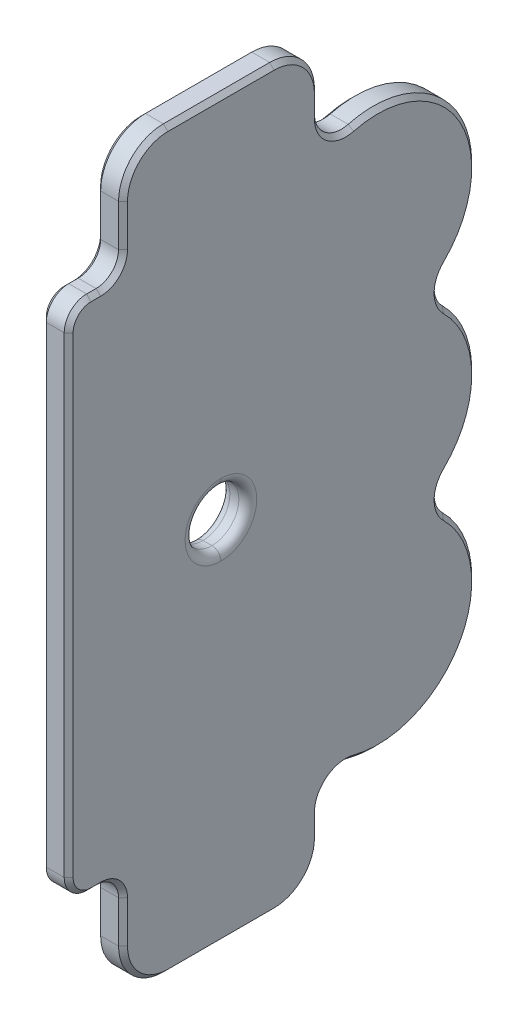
ISO-10303-21;
HEADER;
FILE_DESCRIPTION(('STEP AP214'),'2;1');
FILE_NAME('part.step','',(''),(''),'','','');
FILE_SCHEMA(('AUTOMOTIVE_DESIGN { 1 0 10303 214 1 1 1 1 }'));
ENDSEC;
DATA;
#1=APPLICATION_CONTEXT('core data for automotive mechanical design processes');
#2=APPLICATION_PROTOCOL_DEFINITION('international standard','automotive_design',2000,#1);
#3=PRODUCT_CONTEXT('',#1,'mechanical');
#4=PRODUCT('Part','Part','',(#3));
#5=PRODUCT_RELATED_PRODUCT_CATEGORY('part','',(#4));
#6=PRODUCT_DEFINITION_FORMATION('','',#4);
#7=PRODUCT_DEFINITION_CONTEXT('part definition',#1,'design');
#8=PRODUCT_DEFINITION('design','',#6,#7);
#9=PRODUCT_DEFINITION_SHAPE('','',#8);
#10=(LENGTH_UNIT() NAMED_UNIT(*) SI_UNIT(.MILLI.,.METRE.));
#11=(NAMED_UNIT(*) PLANE_ANGLE_UNIT() SI_UNIT($,.RADIAN.));
#12=(NAMED_UNIT(*) SI_UNIT($,.STERADIAN.) SOLID_ANGLE_UNIT());
#13=UNCERTAINTY_MEASURE_WITH_UNIT(LENGTH_MEASURE(1.E-05),#10,'distance_accuracy_value','');
#14=(GEOMETRIC_REPRESENTATION_CONTEXT(3) GLOBAL_UNCERTAINTY_ASSIGNED_CONTEXT((#13)) GLOBAL_UNIT_ASSIGNED_CONTEXT((#10,
#11,#12)) REPRESENTATION_CONTEXT('',''));
#15=CARTESIAN_POINT('',(0.,0.,0.));
#16=DIRECTION('',(0.,0.,1.));
#17=DIRECTION('',(1.,0.,0.));
#18=AXIS2_PLACEMENT_3D('',#15,#16,#17);
#19=CARTESIAN_POINT('',(0.,0.,-10.4373763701));
#20=DIRECTION('',(0.707106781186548,0.,0.707106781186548));
#21=DIRECTION('',(0.,-1.,0.));
#22=AXIS2_PLACEMENT_3D('',#19,#20,#21);
#23=PLANE('',#22);
#24=DIRECTION('',(0.707106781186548,0.,-0.707106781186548));
#25=VECTOR('',#24,1.);
#26=CARTESIAN_POINT('',(0.25,36.,-10.6873763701));
#27=LINE('',#26,#25);
#28=CARTESIAN_POINT('',(0.,36.,-10.4373763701));
#29=VERTEX_POINT('',#28);
#30=CARTESIAN_POINT('',(0.5,36.,-10.9373763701));
#31=VERTEX_POINT('',#30);
#32=EDGE_CURVE('E11',#29,#31,#27,.T.);
#33=ORIENTED_EDGE('',*,*,#32,.T.);
#34=DIRECTION('',(0.,-1.,0.));
#35=VECTOR('',#34,1.);
#36=CARTESIAN_POINT('',(0.5,34.7695589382,-10.9373763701));
#37=LINE('',#36,#35);
#38=CARTESIAN_POINT('',(0.5,33.5391178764,-10.9373763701));
#39=VERTEX_POINT('',#38);
#40=EDGE_CURVE('E865',#31,#39,#37,.T.);
#41=ORIENTED_EDGE('',*,*,#40,.T.);
#42=DIRECTION('',(0.707106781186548,0.,-0.707106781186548));
#43=VECTOR('',#42,1.);
#44=CARTESIAN_POINT('',(0.25,33.5391178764,-10.6873763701));
#45=LINE('',#44,#43);
#46=CARTESIAN_POINT('',(0.,33.5391178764,-10.4373763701));
#47=VERTEX_POINT('',#46);
#48=EDGE_CURVE('E655',#47,#39,#45,.T.);
#49=ORIENTED_EDGE('',*,*,#48,.F.);
#50=DIRECTION('',(0.,-1.,0.));
#51=VECTOR('',#50,1.);
#52=CARTESIAN_POINT('',(0.,34.7695589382,-10.4373763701));
#53=LINE('',#52,#51);
#54=EDGE_CURVE('E710',#29,#47,#53,.T.);
#55=ORIENTED_EDGE('',*,*,#54,.F.);
#56=EDGE_LOOP('',(#33,#41,#49,#55));
#57=FACE_BOUND('',#56,.T.);
#58=ADVANCED_FACE('F16',(#57),#23,.F.);
#59=CARTESIAN_POINT('',(-3.5,36.,-5.93737637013));
#60=DIRECTION('',(1.,0.,0.));
#61=DIRECTION('',(0.,-0.258819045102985,-0.965925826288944));
#62=AXIS2_PLACEMENT_3D('',#59,#60,#61);
#63=CONICAL_SURFACE('',#62,0.999999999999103,0.785398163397);
#64=DIRECTION('',(0.707106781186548,0.707106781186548,0.));
#65=VECTOR('',#64,1.);
#66=CARTESIAN_POINT('',(0.25,40.75,-5.93737637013));
#67=LINE('',#66,#65);
#68=CARTESIAN_POINT('',(0.,40.5,-5.93737637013));
#69=VERTEX_POINT('',#68);
#70=CARTESIAN_POINT('',(0.5,41.,-5.93737637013));
#71=VERTEX_POINT('',#70);
#72=EDGE_CURVE('E27',#69,#71,#67,.T.);
#73=ORIENTED_EDGE('',*,*,#72,.T.);
#74=CARTESIAN_POINT('',(0.5,36.,-5.93737637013));
#75=DIRECTION('',(-1.,0.,0.));
#76=DIRECTION('',(0.,1.,0.));
#77=AXIS2_PLACEMENT_3D('',#74,#75,#76);
#78=CIRCLE('',#77,5.);
#79=EDGE_CURVE('E770',#71,#31,#78,.T.);
#80=ORIENTED_EDGE('',*,*,#79,.T.);
#81=ORIENTED_EDGE('',*,*,#32,.F.);
#82=CARTESIAN_POINT('',(0.,36.,-5.93737637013));
#83=DIRECTION('',(-1.,0.,0.));
#84=DIRECTION('',(0.,1.,0.));
#85=AXIS2_PLACEMENT_3D('',#82,#83,#84);
#86=CIRCLE('',#85,4.5);
#87=EDGE_CURVE('E517',#69,#29,#86,.T.);
#88=ORIENTED_EDGE('',*,*,#87,.F.);
#89=EDGE_LOOP('',(#73,#80,#81,#88));
#90=FACE_BOUND('',#89,.T.);
#91=ADVANCED_FACE('F1067',(#90),#63,.T.);
#92=CARTESIAN_POINT('',(0.,40.5,-5.75));
#93=DIRECTION('',(0.707106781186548,-0.707106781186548,0.));
#94=DIRECTION('',(0.,0.,-1.));
#95=AXIS2_PLACEMENT_3D('',#92,#93,#94);
#96=PLANE('',#95);
#97=DIRECTION('',(0.707106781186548,0.707106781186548,0.));
#98=VECTOR('',#97,1.);
#99=CARTESIAN_POINT('',(0.25,40.75,5.92973792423));
#100=LINE('',#99,#98);
#101=CARTESIAN_POINT('',(0.,40.5,5.92973792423));
#102=VERTEX_POINT('',#101);
#103=CARTESIAN_POINT('',(0.5,41.,5.92973792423));
#104=VERTEX_POINT('',#103);
#105=EDGE_CURVE('E633',#102,#104,#100,.T.);
#106=ORIENTED_EDGE('',*,*,#105,.T.);
#107=DIRECTION('',(0.,0.,-1.));
#108=VECTOR('',#107,1.);
#109=CARTESIAN_POINT('',(0.5,41.,-0.00381922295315));
#110=LINE('',#109,#108);
#111=EDGE_CURVE('E832',#104,#71,#110,.T.);
#112=ORIENTED_EDGE('',*,*,#111,.T.);
#113=ORIENTED_EDGE('',*,*,#72,.F.);
#114=DIRECTION('',(0.,0.,-1.));
#115=VECTOR('',#114,1.);
#116=CARTESIAN_POINT('',(0.,40.5,-0.00381922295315));
#117=LINE('',#116,#115);
#118=EDGE_CURVE('E513',#102,#69,#117,.T.);
#119=ORIENTED_EDGE('',*,*,#118,.F.);
#120=EDGE_LOOP('',(#106,#112,#113,#119));
#121=FACE_BOUND('',#120,.T.);
#122=ADVANCED_FACE('F1980',(#121),#96,.F.);
#123=CARTESIAN_POINT('',(-3.5,36.,5.92973792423));
#124=DIRECTION('',(1.,0.,0.));
#125=DIRECTION('',(0.,0.965787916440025,-0.259333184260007));
#126=AXIS2_PLACEMENT_3D('',#123,#124,#125);
#127=CONICAL_SURFACE('',#126,0.999999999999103,0.785398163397);
#128=DIRECTION('',(0.707106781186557,0.000752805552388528,0.707106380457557));
#129=VECTOR('',#128,1.);
#130=CARTESIAN_POINT('',(0.25,36.0050569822,10.6797352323));
#131=LINE('',#130,#129);
#132=CARTESIAN_POINT('',(0.,36.0047908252,10.429735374));
#133=VERTEX_POINT('',#132);
#134=CARTESIAN_POINT('',(0.5,36.0053231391,10.9297350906));
#135=VERTEX_POINT('',#134);
#136=EDGE_CURVE('E650',#133,#135,#131,.T.);
#137=ORIENTED_EDGE('',*,*,#136,.T.);
#138=CARTESIAN_POINT('',(0.5,36.,5.92973792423));
#139=DIRECTION('',(-1.,0.,0.));
#140=DIRECTION('',(0.,1.,0.));
#141=AXIS2_PLACEMENT_3D('',#138,#139,#140);
#142=CIRCLE('',#141,5.);
#143=EDGE_CURVE('E887',#135,#104,#142,.T.);
#144=ORIENTED_EDGE('',*,*,#143,.T.);
#145=ORIENTED_EDGE('',*,*,#105,.F.);
#146=CARTESIAN_POINT('',(0.,36.,5.92973792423));
#147=DIRECTION('',(-1.,0.,0.));
#148=DIRECTION('',(0.,1.,0.));
#149=AXIS2_PLACEMENT_3D('',#146,#147,#148);
#150=CIRCLE('',#149,4.5);
#151=EDGE_CURVE('E518',#133,#102,#150,.T.);
#152=ORIENTED_EDGE('',*,*,#151,.F.);
#153=EDGE_LOOP('',(#137,#144,#145,#152));
#154=FACE_BOUND('',#153,.T.);
#155=ADVANCED_FACE('F1985',(#154),#127,.T.);
#156=CARTESIAN_POINT('',(0.,0.,10.4680670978));
#157=DIRECTION('',(0.707106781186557,-0.000752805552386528,-0.707106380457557));
#158=DIRECTION('',(0.,-0.99999943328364,0.00106462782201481));
#159=AXIS2_PLACEMENT_3D('',#156,#157,#158);
#160=PLANE('',#159);
#161=DIRECTION('',(0.707106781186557,0.000752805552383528,0.707106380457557));
#162=VECTOR('',#161,1.);
#163=CARTESIAN_POINT('',(0.25,31.327641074,10.6847149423));
#164=LINE('',#163,#162);
#165=CARTESIAN_POINT('',(0.,31.327374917,10.4347150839));
#166=VERTEX_POINT('',#165);
#167=CARTESIAN_POINT('',(0.5,31.3279072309,10.9347148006));
#168=VERTEX_POINT('',#167);
#169=EDGE_CURVE('E469',#166,#168,#164,.T.);
#170=ORIENTED_EDGE('',*,*,#169,.T.);
#171=DIRECTION('',(0.,0.99999943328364,-0.00106462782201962));
#172=VECTOR('',#171,1.);
#173=CARTESIAN_POINT('',(0.5,33.666615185,10.9322249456));
#174=LINE('',#173,#172);
#175=EDGE_CURVE('E894',#168,#135,#174,.T.);
#176=ORIENTED_EDGE('',*,*,#175,.T.);
#177=ORIENTED_EDGE('',*,*,#136,.F.);
#178=DIRECTION('',(0.,0.99999943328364,-0.00106462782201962));
#179=VECTOR('',#178,1.);
#180=CARTESIAN_POINT('',(0.,33.6660828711,10.432225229));
#181=LINE('',#180,#179);
#182=EDGE_CURVE('E725',#166,#133,#181,.T.);
#183=ORIENTED_EDGE('',*,*,#182,.F.);
#184=EDGE_LOOP('',(#170,#176,#177,#183));
#185=FACE_BOUND('',#184,.T.);
#186=ADVANCED_FACE('F2119',(#185),#160,.F.);
#187=CARTESIAN_POINT('',(2.,31.3305688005,13.4347133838));
#188=DIRECTION('',(-1.,0.,0.));
#189=DIRECTION('',(0.,-0.96564973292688,0.259847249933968));
#190=AXIS2_PLACEMENT_3D('',#187,#188,#189);
#191=CONICAL_SURFACE('',#190,0.999999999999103,0.785398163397);
#192=DIRECTION('',(0.707106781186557,0.707106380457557,-0.000752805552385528));
#193=VECTOR('',#192,1.);
#194=CARTESIAN_POINT('',(0.25,28.580570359,13.4376411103));
#195=LINE('',#194,#193);
#196=CARTESIAN_POINT('',(0.,28.3305705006,13.4379072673));
#197=VERTEX_POINT('',#196);
#198=CARTESIAN_POINT('',(0.5,28.8305702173,13.4373749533));
#199=VERTEX_POINT('',#198);
#200=EDGE_CURVE('E465',#197,#199,#195,.T.);
#201=ORIENTED_EDGE('',*,*,#200,.T.);
#202=CARTESIAN_POINT('',(0.5,31.3305688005,13.4347133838));
#203=DIRECTION('',(1.,0.,0.));
#204=DIRECTION('',(0.,1.,0.));
#205=AXIS2_PLACEMENT_3D('',#202,#203,#204);
#206=CIRCLE('',#205,2.5);
#207=EDGE_CURVE('E431',#199,#168,#206,.T.);
#208=ORIENTED_EDGE('',*,*,#207,.T.);
#209=ORIENTED_EDGE('',*,*,#169,.F.);
#210=CARTESIAN_POINT('',(0.,31.3305688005,13.4347133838));
#211=DIRECTION('',(1.,0.,0.));
#212=DIRECTION('',(0.,1.,0.));
#213=AXIS2_PLACEMENT_3D('',#210,#211,#212);
#214=CIRCLE('',#213,3.);
#215=EDGE_CURVE('E20',#197,#166,#214,.T.);
#216=ORIENTED_EDGE('',*,*,#215,.F.);
#217=EDGE_LOOP('',(#201,#208,#209,#216));
#218=FACE_BOUND('',#217,.T.);
#219=ADVANCED_FACE('F2114',(#218),#191,.F.);
#220=CARTESIAN_POINT('',(0.,28.3101425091,-5.75));
#221=DIRECTION('',(0.707106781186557,-0.707106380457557,0.000752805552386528));
#222=DIRECTION('',(0.,-0.00106462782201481,-0.99999943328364));
#223=AXIS2_PLACEMENT_3D('',#220,#221,#222);
#224=PLANE('',#223);
#225=DIRECTION('',(0.707106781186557,0.707106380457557,-0.000752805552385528));
#226=VECTOR('',#225,1.);
#227=CARTESIAN_POINT('',(0.25,28.5816988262,14.4976045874));
#228=LINE('',#227,#226);
#229=CARTESIAN_POINT('',(0.,28.3316989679,14.4978707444));
#230=VERTEX_POINT('',#229);
#231=CARTESIAN_POINT('',(0.5,28.8316986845,14.4973384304));
#232=VERTEX_POINT('',#231);
#233=EDGE_CURVE('E470',#230,#232,#228,.T.);
#234=ORIENTED_EDGE('',*,*,#233,.T.);
#235=DIRECTION('',(0.,-0.00106462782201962,-0.99999943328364));
#236=VECTOR('',#235,1.);
#237=CARTESIAN_POINT('',(0.5,28.8311344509,13.9673566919));
#238=LINE('',#237,#236);
#239=EDGE_CURVE('E620',#232,#199,#238,.T.);
#240=ORIENTED_EDGE('',*,*,#239,.T.);
#241=ORIENTED_EDGE('',*,*,#200,.F.);
#242=DIRECTION('',(0.,-0.00106462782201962,-0.99999943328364));
#243=VECTOR('',#242,1.);
#244=CARTESIAN_POINT('',(0.,28.3311347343,13.9678890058));
#245=LINE('',#244,#243);
#246=EDGE_CURVE('E615',#230,#197,#245,.T.);
#247=ORIENTED_EDGE('',*,*,#246,.F.);
#248=EDGE_LOOP('',(#234,#240,#241,#247));
#249=FACE_BOUND('',#248,.T.);
#250=ADVANCED_FACE('F1302',(#249),#224,.F.);
#251=CARTESIAN_POINT('',(-1.,26.3317001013,14.5));
#252=DIRECTION('',(1.,0.,0.));
#253=DIRECTION('',(0.,0.965787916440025,-0.259333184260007));
#254=AXIS2_PLACEMENT_3D('',#251,#252,#253);
#255=CONICAL_SURFACE('',#254,0.999999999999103,0.785398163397);
#256=DIRECTION('',(0.707106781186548,0.,0.707106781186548));
#257=VECTOR('',#256,1.);
#258=CARTESIAN_POINT('',(0.25,26.3317001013,16.75));
#259=LINE('',#258,#257);
#260=CARTESIAN_POINT('',(0.,26.3317001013,16.5));
#261=VERTEX_POINT('',#260);
#262=CARTESIAN_POINT('',(0.5,26.3317001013,17.));
#263=VERTEX_POINT('',#262);
#264=EDGE_CURVE('E780',#261,#263,#259,.T.);
#265=ORIENTED_EDGE('',*,*,#264,.T.);
#266=CARTESIAN_POINT('',(0.5,26.3317001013,14.5));
#267=DIRECTION('',(-1.,0.,0.));
#268=DIRECTION('',(0.,1.,0.));
#269=AXIS2_PLACEMENT_3D('',#266,#267,#268);
#270=CIRCLE('',#269,2.5);
#271=EDGE_CURVE('E565',#263,#232,#270,.T.);
#272=ORIENTED_EDGE('',*,*,#271,.T.);
#273=ORIENTED_EDGE('',*,*,#233,.F.);
#274=CARTESIAN_POINT('',(0.,26.3317001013,14.5));
#275=DIRECTION('',(-1.,0.,0.));
#276=DIRECTION('',(0.,1.,0.));
#277=AXIS2_PLACEMENT_3D('',#274,#275,#276);
#278=CIRCLE('',#277,2.);
#279=EDGE_CURVE('E487',#261,#230,#278,.T.);
#280=ORIENTED_EDGE('',*,*,#279,.F.);
#281=EDGE_LOOP('',(#265,#272,#273,#280));
#282=FACE_BOUND('',#281,.T.);
#283=ADVANCED_FACE('F1307',(#282),#255,.T.);
#284=CARTESIAN_POINT('',(0.,0.,16.5));
#285=DIRECTION('',(0.707106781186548,0.,-0.707106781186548));
#286=DIRECTION('',(0.,-1.,0.));
#287=AXIS2_PLACEMENT_3D('',#284,#285,#286);
#288=PLANE('',#287);
#289=DIRECTION('',(0.707106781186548,0.,0.707106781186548));
#290=VECTOR('',#289,1.);
#291=CARTESIAN_POINT('',(0.25,-26.3317001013,16.75));
#292=LINE('',#291,#290);
#293=CARTESIAN_POINT('',(0.,-26.3317001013,16.5));
#294=VERTEX_POINT('',#293);
#295=CARTESIAN_POINT('',(0.5,-26.3317001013,17.));
#296=VERTEX_POINT('',#295);
#297=EDGE_CURVE('E784',#294,#296,#292,.T.);
#298=ORIENTED_EDGE('',*,*,#297,.T.);
#299=DIRECTION('',(0.,1.,0.));
#300=VECTOR('',#299,1.);
#301=CARTESIAN_POINT('',(0.5,0.,17.));
#302=LINE('',#301,#300);
#303=EDGE_CURVE('E561',#296,#263,#302,.T.);
#304=ORIENTED_EDGE('',*,*,#303,.T.);
#305=ORIENTED_EDGE('',*,*,#264,.F.);
#306=DIRECTION('',(0.,1.,0.));
#307=VECTOR('',#306,1.);
#308=CARTESIAN_POINT('',(0.,0.,16.5));
#309=LINE('',#308,#307);
#310=EDGE_CURVE('E483',#294,#261,#309,.T.);
#311=ORIENTED_EDGE('',*,*,#310,.F.);
#312=EDGE_LOOP('',(#298,#304,#305,#311));
#313=FACE_BOUND('',#312,.T.);
#314=ADVANCED_FACE('F1993',(#313),#288,.F.);
#315=CARTESIAN_POINT('',(-1.,-26.3317001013,14.5));
#316=DIRECTION('',(1.,0.,0.));
#317=DIRECTION('',(0.,0.258304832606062,0.966063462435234));
#318=AXIS2_PLACEMENT_3D('',#315,#316,#317);
#319=CONICAL_SURFACE('',#318,0.999999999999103,0.785398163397);
#320=DIRECTION('',(0.707106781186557,-0.707106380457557,-0.000752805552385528));
#321=VECTOR('',#320,1.);
#322=CARTESIAN_POINT('',(0.25,-28.5816988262,14.4976045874));
#323=LINE('',#322,#321);
#324=CARTESIAN_POINT('',(0.,-28.3316989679,14.4978707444));
#325=VERTEX_POINT('',#324);
#326=CARTESIAN_POINT('',(0.5,-28.8316986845,14.4973384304));
#327=VERTEX_POINT('',#326);
#328=EDGE_CURVE('E691',#325,#327,#323,.T.);
#329=ORIENTED_EDGE('',*,*,#328,.T.);
#330=CARTESIAN_POINT('',(0.5,-26.3317001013,14.5));
#331=DIRECTION('',(-1.,0.,0.));
#332=DIRECTION('',(0.,1.,0.));
#333=AXIS2_PLACEMENT_3D('',#330,#331,#332);
#334=CIRCLE('',#333,2.5);
#335=EDGE_CURVE('E726',#327,#296,#334,.T.);
#336=ORIENTED_EDGE('',*,*,#335,.T.);
#337=ORIENTED_EDGE('',*,*,#297,.F.);
#338=CARTESIAN_POINT('',(0.,-26.3317001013,14.5));
#339=DIRECTION('',(-1.,0.,0.));
#340=DIRECTION('',(0.,1.,0.));
#341=AXIS2_PLACEMENT_3D('',#338,#339,#340);
#342=CIRCLE('',#341,2.);
#343=EDGE_CURVE('E488',#325,#294,#342,.T.);
#344=ORIENTED_EDGE('',*,*,#343,.F.);
#345=EDGE_LOOP('',(#329,#336,#337,#344));
#346=FACE_BOUND('',#345,.T.);
#347=ADVANCED_FACE('F1324',(#346),#319,.T.);
#348=CARTESIAN_POINT('',(0.,-28.3101425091,-5.75));
#349=DIRECTION('',(0.707106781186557,0.707106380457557,0.000752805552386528));
#350=DIRECTION('',(0.,0.00106462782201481,-0.99999943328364));
#351=AXIS2_PLACEMENT_3D('',#348,#349,#350);
#352=PLANE('',#351);
#353=DIRECTION('',(0.707106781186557,-0.707106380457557,-0.000752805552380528));
#354=VECTOR('',#353,1.);
#355=CARTESIAN_POINT('',(0.25,-28.580570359,13.4376411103));
#356=LINE('',#355,#354);
#357=CARTESIAN_POINT('',(0.,-28.3305705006,13.4379072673));
#358=VERTEX_POINT('',#357);
#359=CARTESIAN_POINT('',(0.5,-28.8305702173,13.4373749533));
#360=VERTEX_POINT('',#359);
#361=EDGE_CURVE('E684',#358,#360,#356,.T.);
#362=ORIENTED_EDGE('',*,*,#361,.T.);
#363=DIRECTION('',(0.,-0.00106462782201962,0.99999943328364));
#364=VECTOR('',#363,1.);
#365=CARTESIAN_POINT('',(0.5,-28.8311344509,13.9673566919));
#366=LINE('',#365,#364);
#367=EDGE_CURVE('E730',#360,#327,#366,.T.);
#368=ORIENTED_EDGE('',*,*,#367,.T.);
#369=ORIENTED_EDGE('',*,*,#328,.F.);
#370=DIRECTION('',(0.,-0.00106462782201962,0.99999943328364));
#371=VECTOR('',#370,1.);
#372=CARTESIAN_POINT('',(0.,-28.3311347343,13.9678890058));
#373=LINE('',#372,#371);
#374=EDGE_CURVE('E508',#358,#325,#373,.T.);
#375=ORIENTED_EDGE('',*,*,#374,.F.);
#376=EDGE_LOOP('',(#362,#368,#369,#375));
#377=FACE_BOUND('',#376,.T.);
#378=ADVANCED_FACE('F1320',(#377),#352,.F.);
#379=CARTESIAN_POINT('',(2.,-31.3305688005,13.4347133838));
#380=DIRECTION('',(-1.,0.,0.));
#381=DIRECTION('',(0.,-0.257790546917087,-0.966200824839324));
#382=AXIS2_PLACEMENT_3D('',#379,#380,#381);
#383=CONICAL_SURFACE('',#382,0.999999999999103,0.785398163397);
#384=DIRECTION('',(0.707106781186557,-0.000752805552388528,0.707106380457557));
#385=VECTOR('',#384,1.);
#386=CARTESIAN_POINT('',(0.25,-31.327641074,10.6847149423));
#387=LINE('',#386,#385);
#388=CARTESIAN_POINT('',(0.,-31.327374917,10.4347150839));
#389=VERTEX_POINT('',#388);
#390=CARTESIAN_POINT('',(0.5,-31.3279072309,10.9347148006));
#391=VERTEX_POINT('',#390);
#392=EDGE_CURVE('E539',#389,#391,#387,.T.);
#393=ORIENTED_EDGE('',*,*,#392,.T.);
#394=CARTESIAN_POINT('',(0.5,-31.3305688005,13.4347133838));
#395=DIRECTION('',(1.,0.,0.));
#396=DIRECTION('',(0.,1.,0.));
#397=AXIS2_PLACEMENT_3D('',#394,#395,#396);
#398=CIRCLE('',#397,2.5);
#399=EDGE_CURVE('E601',#391,#360,#398,.T.);
#400=ORIENTED_EDGE('',*,*,#399,.T.);
#401=ORIENTED_EDGE('',*,*,#361,.F.);
#402=CARTESIAN_POINT('',(0.,-31.3305688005,13.4347133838));
#403=DIRECTION('',(1.,0.,0.));
#404=DIRECTION('',(0.,1.,0.));
#405=AXIS2_PLACEMENT_3D('',#402,#403,#404);
#406=CIRCLE('',#405,3.);
#407=EDGE_CURVE('E504',#389,#358,#406,.T.);
#408=ORIENTED_EDGE('',*,*,#407,.F.);
#409=EDGE_LOOP('',(#393,#400,#401,#408));
#410=FACE_BOUND('',#409,.T.);
#411=ADVANCED_FACE('F1223',(#410),#383,.F.);
#412=CARTESIAN_POINT('',(0.,0.,10.4680670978));
#413=DIRECTION('',(-0.707106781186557,-0.000752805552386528,0.707106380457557));
#414=DIRECTION('',(-0.00106462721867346,0.999999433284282,0.));
#415=AXIS2_PLACEMENT_3D('',#412,#413,#414);
#416=PLANE('',#415);
#417=DIRECTION('',(0.707106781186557,-0.000752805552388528,0.707106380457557));
#418=VECTOR('',#417,1.);
#419=CARTESIAN_POINT('',(0.25,-36.0050569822,10.6797352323));
#420=LINE('',#419,#418);
#421=CARTESIAN_POINT('',(0.,-36.0047908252,10.429735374));
#422=VERTEX_POINT('',#421);
#423=CARTESIAN_POINT('',(0.5,-36.0053231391,10.9297350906));
#424=VERTEX_POINT('',#423);
#425=EDGE_CURVE('E421',#422,#424,#420,.T.);
#426=ORIENTED_EDGE('',*,*,#425,.T.);
#427=DIRECTION('',(0.,0.99999943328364,0.00106462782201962));
#428=VECTOR('',#427,1.);
#429=CARTESIAN_POINT('',(0.5,-33.666615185,10.9322249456));
#430=LINE('',#429,#428);
#431=EDGE_CURVE('E401',#424,#391,#430,.T.);
#432=ORIENTED_EDGE('',*,*,#431,.T.);
#433=ORIENTED_EDGE('',*,*,#392,.F.);
#434=DIRECTION('',(0.,0.99999943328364,0.00106462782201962));
#435=VECTOR('',#434,1.);
#436=CARTESIAN_POINT('',(0.,-33.6660828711,10.432225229));
#437=LINE('',#436,#435);
#438=EDGE_CURVE('E509',#422,#389,#437,.T.);
#439=ORIENTED_EDGE('',*,*,#438,.F.);
#440=EDGE_LOOP('',(#426,#432,#433,#439));
#441=FACE_BOUND('',#440,.T.);
#442=ADVANCED_FACE('F1188',(#441),#416,.T.);
#443=CARTESIAN_POINT('',(-3.5,-36.,5.92973792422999));
#444=DIRECTION('',(1.,0.,0.));
#445=DIRECTION('',(0.,0.258304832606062,0.966063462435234));
#446=AXIS2_PLACEMENT_3D('',#443,#444,#445);
#447=CONICAL_SURFACE('',#446,0.999999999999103,0.785398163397);
#448=DIRECTION('',(0.707106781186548,-0.707106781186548,0.));
#449=VECTOR('',#448,1.);
#450=CARTESIAN_POINT('',(0.25,-40.75,5.92973792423));
#451=LINE('',#450,#449);
#452=CARTESIAN_POINT('',(0.,-40.5,5.92973792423));
#453=VERTEX_POINT('',#452);
#454=CARTESIAN_POINT('',(0.5,-41.,5.92973792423));
#455=VERTEX_POINT('',#454);
#456=EDGE_CURVE('E417',#453,#455,#451,.T.);
#457=ORIENTED_EDGE('',*,*,#456,.T.);
#458=CARTESIAN_POINT('',(0.5,-36.,5.92973792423));
#459=DIRECTION('',(-1.,0.,0.));
#460=DIRECTION('',(0.,1.,0.));
#461=AXIS2_PLACEMENT_3D('',#458,#459,#460);
#462=CIRCLE('',#461,5.);
#463=EDGE_CURVE('E482',#455,#424,#462,.T.);
#464=ORIENTED_EDGE('',*,*,#463,.T.);
#465=ORIENTED_EDGE('',*,*,#425,.F.);
#466=CARTESIAN_POINT('',(0.,-36.,5.92973792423));
#467=DIRECTION('',(-1.,0.,0.));
#468=DIRECTION('',(0.,1.,0.));
#469=AXIS2_PLACEMENT_3D('',#466,#467,#468);
#470=CIRCLE('',#469,4.5);
#471=EDGE_CURVE('E634',#453,#422,#470,.T.);
#472=ORIENTED_EDGE('',*,*,#471,.F.);
#473=EDGE_LOOP('',(#457,#464,#465,#472));
#474=FACE_BOUND('',#473,.T.);
#475=ADVANCED_FACE('F1194',(#474),#447,.T.);
#476=CARTESIAN_POINT('',(0.,-40.5,-5.75));
#477=DIRECTION('',(-0.707106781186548,-0.707106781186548,0.));
#478=DIRECTION('',(-0.707106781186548,0.707106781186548,0.));
#479=AXIS2_PLACEMENT_3D('',#476,#477,#478);
#480=PLANE('',#479);
#481=DIRECTION('',(0.707106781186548,-0.707106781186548,0.));
#482=VECTOR('',#481,1.);
#483=CARTESIAN_POINT('',(0.25,-40.75,-5.93737637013));
#484=LINE('',#483,#482);
#485=CARTESIAN_POINT('',(0.,-40.5,-5.93737637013));
#486=VERTEX_POINT('',#485);
#487=CARTESIAN_POINT('',(0.5,-41.,-5.93737637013));
#488=VERTEX_POINT('',#487);
#489=EDGE_CURVE('E413',#486,#488,#484,.T.);
#490=ORIENTED_EDGE('',*,*,#489,.T.);
#491=DIRECTION('',(0.,0.,1.));
#492=VECTOR('',#491,1.);
#493=CARTESIAN_POINT('',(0.5,-41.,-0.00381922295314));
#494=LINE('',#493,#492);
#495=EDGE_CURVE('E481',#488,#455,#494,.T.);
#496=ORIENTED_EDGE('',*,*,#495,.T.);
#497=ORIENTED_EDGE('',*,*,#456,.F.);
#498=DIRECTION('',(0.,0.,1.));
#499=VECTOR('',#498,1.);
#500=CARTESIAN_POINT('',(0.,-40.5,-0.00381922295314));
#501=LINE('',#500,#499);
#502=EDGE_CURVE('E426',#486,#453,#501,.T.);
#503=ORIENTED_EDGE('',*,*,#502,.F.);
#504=EDGE_LOOP('',(#490,#496,#497,#503));
#505=FACE_BOUND('',#504,.T.);
#506=ADVANCED_FACE('F1232',(#505),#480,.T.);
#507=CARTESIAN_POINT('',(-3.5,-36.,-5.93737637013));
#508=DIRECTION('',(1.,0.,0.));
#509=DIRECTION('',(0.,-0.965925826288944,0.258819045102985));
#510=AXIS2_PLACEMENT_3D('',#507,#508,#509);
#511=CONICAL_SURFACE('',#510,0.999999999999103,0.785398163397);
#512=DIRECTION('',(0.707106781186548,0.,-0.707106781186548));
#513=VECTOR('',#512,1.);
#514=CARTESIAN_POINT('',(0.25,-36.,-10.6873763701));
#515=LINE('',#514,#513);
#516=CARTESIAN_POINT('',(0.,-36.,-10.4373763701));
#517=VERTEX_POINT('',#516);
#518=CARTESIAN_POINT('',(0.5,-36.,-10.9373763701));
#519=VERTEX_POINT('',#518);
#520=EDGE_CURVE('E418',#517,#519,#515,.T.);
#521=ORIENTED_EDGE('',*,*,#520,.T.);
#522=CARTESIAN_POINT('',(0.5,-36.,-5.93737637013));
#523=DIRECTION('',(-1.,0.,0.));
#524=DIRECTION('',(0.,1.,0.));
#525=AXIS2_PLACEMENT_3D('',#522,#523,#524);
#526=CIRCLE('',#525,5.);
#527=EDGE_CURVE('E688',#519,#488,#526,.T.);
#528=ORIENTED_EDGE('',*,*,#527,.T.);
#529=ORIENTED_EDGE('',*,*,#489,.F.);
#530=CARTESIAN_POINT('',(0.,-36.,-5.93737637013));
#531=DIRECTION('',(-1.,0.,0.));
#532=DIRECTION('',(0.,1.,0.));
#533=AXIS2_PLACEMENT_3D('',#530,#531,#532);
#534=CIRCLE('',#533,4.5);
#535=EDGE_CURVE('E422',#517,#486,#534,.T.);
#536=ORIENTED_EDGE('',*,*,#535,.F.);
#537=EDGE_LOOP('',(#521,#528,#529,#536));
#538=FACE_BOUND('',#537,.T.);
#539=ADVANCED_FACE('F2051',(#538),#511,.T.);
#540=CARTESIAN_POINT('',(0.,0.,-10.4373763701));
#541=DIRECTION('',(-0.707106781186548,0.,-0.707106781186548));
#542=DIRECTION('',(-0.707106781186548,0.,0.707106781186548));
#543=AXIS2_PLACEMENT_3D('',#540,#541,#542);
#544=PLANE('',#543);
#545=DIRECTION('',(0.707106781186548,0.,-0.707106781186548));
#546=VECTOR('',#545,1.);
#547=CARTESIAN_POINT('',(0.25,-33.5391178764,-10.6873763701));
#548=LINE('',#547,#546);
#549=CARTESIAN_POINT('',(0.,-33.5391178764,-10.4373763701));
#550=VERTEX_POINT('',#549);
#551=CARTESIAN_POINT('',(0.5,-33.5391178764,-10.9373763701));
#552=VERTEX_POINT('',#551);
#553=EDGE_CURVE('E440',#550,#552,#548,.T.);
#554=ORIENTED_EDGE('',*,*,#553,.T.);
#555=DIRECTION('',(0.,-1.,0.));
#556=VECTOR('',#555,1.);
#557=CARTESIAN_POINT('',(0.5,-34.7695589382,-10.9373763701));
#558=LINE('',#557,#556);
#559=EDGE_CURVE('E408',#552,#519,#558,.T.);
#560=ORIENTED_EDGE('',*,*,#559,.T.);
#561=ORIENTED_EDGE('',*,*,#520,.F.);
#562=DIRECTION('',(0.,-1.,0.));
#563=VECTOR('',#562,1.);
#564=CARTESIAN_POINT('',(0.,-34.7695589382,-10.4373763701));
#565=LINE('',#564,#563);
#566=EDGE_CURVE('E384',#550,#517,#565,.T.);
#567=ORIENTED_EDGE('',*,*,#566,.F.);
#568=EDGE_LOOP('',(#554,#560,#561,#567));
#569=FACE_BOUND('',#568,.T.);
#570=ADVANCED_FACE('F1961',(#569),#544,.T.);
#571=CARTESIAN_POINT('',(2.5,-33.5391178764,-13.9373763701));
#572=DIRECTION('',(-1.,0.,0.));
#573=DIRECTION('',(0.,0.92473757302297,-0.380605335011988));
#574=AXIS2_PLACEMENT_3D('',#571,#572,#573);
#575=CONICAL_SURFACE('',#574,0.999999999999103,0.785398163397);
#576=DIRECTION('',(0.707106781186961,-0.683828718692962,0.17993966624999));
#577=VECTOR('',#576,1.);
#578=CARTESIAN_POINT('',(0.25,-30.3961083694,-14.7644139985));
#579=LINE('',#578,#577);
#580=CARTESIAN_POINT('',(0.,-30.1543384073,-14.8280322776));
#581=VERTEX_POINT('',#580);
#582=CARTESIAN_POINT('',(0.5,-30.6378783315,-14.7007957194));
#583=VERTEX_POINT('',#582);
#584=EDGE_CURVE('E458',#581,#583,#579,.T.);
#585=ORIENTED_EDGE('',*,*,#584,.T.);
#586=CARTESIAN_POINT('',(0.5,-33.5391178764,-13.9373763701));
#587=DIRECTION('',(1.,0.,0.));
#588=DIRECTION('',(0.,-1.,0.));
#589=AXIS2_PLACEMENT_3D('',#586,#587,#588);
#590=CIRCLE('',#589,3.);
#591=EDGE_CURVE('E407',#583,#552,#590,.T.);
#592=ORIENTED_EDGE('',*,*,#591,.T.);
#593=ORIENTED_EDGE('',*,*,#553,.F.);
#594=CARTESIAN_POINT('',(0.,-33.5391178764,-13.9373763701));
#595=DIRECTION('',(1.,0.,0.));
#596=DIRECTION('',(0.,1.,0.));
#597=AXIS2_PLACEMENT_3D('',#594,#595,#596);
#598=CIRCLE('',#597,3.5);
#599=EDGE_CURVE('E1005',#581,#550,#598,.T.);
#600=ORIENTED_EDGE('',*,*,#599,.F.);
#601=EDGE_LOOP('',(#585,#592,#593,#600));
#602=FACE_BOUND('',#601,.T.);
#603=ADVANCED_FACE('F1949',(#602),#575,.F.);
#604=CARTESIAN_POINT('',(-9.5,-20.,-17.5));
#605=DIRECTION('',(1.,0.,0.));
#606=DIRECTION('',(0.,0.509393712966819,0.860533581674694));
#607=AXIS2_PLACEMENT_3D('',#604,#605,#606);
#608=CONICAL_SURFACE('',#607,0.999999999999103,0.785398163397);
#609=DIRECTION('',(0.707106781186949,0.505076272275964,-0.494871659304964));
#610=VECTOR('',#609,1.);
#611=CARTESIAN_POINT('',(0.25,-12.3214285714,-25.0234327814));
#612=LINE('',#611,#610);
#613=CARTESIAN_POINT('',(0.,-12.5,-24.8484692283));
#614=VERTEX_POINT('',#613);
#615=CARTESIAN_POINT('',(0.5,-12.1428571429,-25.1983963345));
#616=VERTEX_POINT('',#615);
#617=EDGE_CURVE('E572',#614,#616,#612,.T.);
#618=ORIENTED_EDGE('',*,*,#617,.T.);
#619=CARTESIAN_POINT('',(0.5,-20.,-17.5));
#620=DIRECTION('',(-1.,0.,0.));
#621=DIRECTION('',(0.,1.,0.));
#622=AXIS2_PLACEMENT_3D('',#619,#620,#621);
#623=CIRCLE('',#622,11.);
#624=EDGE_CURVE('E804',#616,#583,#623,.T.);
#625=ORIENTED_EDGE('',*,*,#624,.T.);
#626=ORIENTED_EDGE('',*,*,#584,.F.);
#627=CARTESIAN_POINT('',(0.,-20.,-17.5));
#628=DIRECTION('',(-1.,0.,0.));
#629=DIRECTION('',(0.,1.,0.));
#630=AXIS2_PLACEMENT_3D('',#627,#628,#629);
#631=CIRCLE('',#630,10.5);
#632=EDGE_CURVE('E659',#614,#581,#631,.T.);
#633=ORIENTED_EDGE('',*,*,#632,.F.);
#634=EDGE_LOOP('',(#618,#625,#626,#633));
#635=FACE_BOUND('',#634,.T.);
#636=ADVANCED_FACE('F1943',(#635),#608,.T.);
#637=CARTESIAN_POINT('',(2.5,-10.,-27.2979589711));
#638=DIRECTION('',(-1.,0.,0.));
#639=DIRECTION('',(0.,0.866025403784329,0.50000000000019));
#640=AXIS2_PLACEMENT_3D('',#637,#638,#639);
#641=CONICAL_SURFACE('',#640,0.999999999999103,0.785398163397);
#642=DIRECTION('',(0.707106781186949,-0.505076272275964,-0.494871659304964));
#643=VECTOR('',#642,1.);
#644=CARTESIAN_POINT('',(0.25,-7.67857142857,-25.0234327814));
#645=LINE('',#644,#643);
#646=CARTESIAN_POINT('',(0.,-7.5,-24.8484692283));
#647=VERTEX_POINT('',#646);
#648=CARTESIAN_POINT('',(0.5,-7.85714285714,-25.1983963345));
#649=VERTEX_POINT('',#648);
#650=EDGE_CURVE('E41',#647,#649,#645,.T.);
#651=ORIENTED_EDGE('',*,*,#650,.T.);
#652=CARTESIAN_POINT('',(0.5,-10.,-27.2979589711));
#653=DIRECTION('',(1.,0.,0.));
#654=DIRECTION('',(0.,1.,0.));
#655=AXIS2_PLACEMENT_3D('',#652,#653,#654);
#656=CIRCLE('',#655,3.);
#657=EDGE_CURVE('E850',#649,#616,#656,.T.);
#658=ORIENTED_EDGE('',*,*,#657,.T.);
#659=ORIENTED_EDGE('',*,*,#617,.F.);
#660=CARTESIAN_POINT('',(0.,-10.,-27.2979589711));
#661=DIRECTION('',(1.,0.,0.));
#662=DIRECTION('',(0.,1.,0.));
#663=AXIS2_PLACEMENT_3D('',#660,#661,#662);
#664=CIRCLE('',#663,3.5);
#665=EDGE_CURVE('E656',#647,#614,#664,.T.);
#666=ORIENTED_EDGE('',*,*,#665,.F.);
#667=EDGE_LOOP('',(#651,#658,#659,#666));
#668=FACE_BOUND('',#667,.T.);
#669=ADVANCED_FACE('F1948',(#668),#641,.F.);
#670=CARTESIAN_POINT('',(-9.5,0.,-17.5));
#671=DIRECTION('',(1.,0.,0.));
#672=DIRECTION('',(0.,-0.866025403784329,-0.50000000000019));
#673=AXIS2_PLACEMENT_3D('',#670,#671,#672);
#674=CONICAL_SURFACE('',#673,0.999999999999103,0.785398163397);
#675=DIRECTION('',(0.707106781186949,0.505076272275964,-0.494871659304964));
#676=VECTOR('',#675,1.);
#677=CARTESIAN_POINT('',(0.25,7.67857142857,-25.0234327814));
#678=LINE('',#677,#676);
#679=CARTESIAN_POINT('',(0.,7.5,-24.8484692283));
#680=VERTEX_POINT('',#679);
#681=CARTESIAN_POINT('',(0.5,7.85714285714,-25.1983963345));
#682=VERTEX_POINT('',#681);
#683=EDGE_CURVE('E318',#680,#682,#678,.T.);
#684=ORIENTED_EDGE('',*,*,#683,.T.);
#685=CARTESIAN_POINT('',(0.5,0.,-17.5));
#686=DIRECTION('',(-1.,0.,0.));
#687=DIRECTION('',(0.,1.,0.));
#688=AXIS2_PLACEMENT_3D('',#685,#686,#687);
#689=CIRCLE('',#688,11.);
#690=EDGE_CURVE('E855',#682,#649,#689,.T.);
#691=ORIENTED_EDGE('',*,*,#690,.T.);
#692=ORIENTED_EDGE('',*,*,#650,.F.);
#693=CARTESIAN_POINT('',(0.,0.,-17.5));
#694=DIRECTION('',(-1.,0.,0.));
#695=DIRECTION('',(0.,1.,0.));
#696=AXIS2_PLACEMENT_3D('',#693,#694,#695);
#697=CIRCLE('',#696,10.5);
#698=EDGE_CURVE('E660',#680,#647,#697,.T.);
#699=ORIENTED_EDGE('',*,*,#698,.F.);
#700=EDGE_LOOP('',(#684,#691,#692,#699));
#701=FACE_BOUND('',#700,.T.);
#702=ADVANCED_FACE('F968',(#701),#674,.T.);
#703=CARTESIAN_POINT('',(2.5,10.,-27.2979589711));
#704=DIRECTION('',(-1.,0.,0.));
#705=DIRECTION('',(0.,0.866025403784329,0.50000000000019));
#706=AXIS2_PLACEMENT_3D('',#703,#704,#705);
#707=CONICAL_SURFACE('',#706,0.999999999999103,0.785398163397);
#708=DIRECTION('',(0.707106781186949,-0.505076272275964,-0.494871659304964));
#709=VECTOR('',#708,1.);
#710=CARTESIAN_POINT('',(0.25,12.3214285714,-25.0234327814));
#711=LINE('',#710,#709);
#712=CARTESIAN_POINT('',(0.,12.5,-24.8484692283));
#713=VERTEX_POINT('',#712);
#714=CARTESIAN_POINT('',(0.5,12.1428571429,-25.1983963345));
#715=VERTEX_POINT('',#714);
#716=EDGE_CURVE('E654',#713,#715,#711,.T.);
#717=ORIENTED_EDGE('',*,*,#716,.T.);
#718=CARTESIAN_POINT('',(0.5,10.,-27.2979589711));
#719=DIRECTION('',(1.,0.,0.));
#720=DIRECTION('',(0.,1.,0.));
#721=AXIS2_PLACEMENT_3D('',#718,#719,#720);
#722=CIRCLE('',#721,3.);
#723=EDGE_CURVE('E589',#715,#682,#722,.T.);
#724=ORIENTED_EDGE('',*,*,#723,.T.);
#725=ORIENTED_EDGE('',*,*,#683,.F.);
#726=CARTESIAN_POINT('',(0.,10.,-27.2979589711));
#727=DIRECTION('',(1.,0.,0.));
#728=DIRECTION('',(0.,1.,0.));
#729=AXIS2_PLACEMENT_3D('',#726,#727,#728);
#730=CIRCLE('',#729,3.5);
#731=EDGE_CURVE('E629',#713,#680,#730,.T.);
#732=ORIENTED_EDGE('',*,*,#731,.F.);
#733=EDGE_LOOP('',(#717,#724,#725,#732));
#734=FACE_BOUND('',#733,.T.);
#735=ADVANCED_FACE('F1931',(#734),#707,.F.);
#736=CARTESIAN_POINT('',(-9.5,20.,-17.5));
#737=DIRECTION('',(1.,0.,0.));
#738=DIRECTION('',(0.,-0.509393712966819,0.860533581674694));
#739=AXIS2_PLACEMENT_3D('',#736,#737,#738);
#740=CONICAL_SURFACE('',#739,0.999999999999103,0.785398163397);
#741=DIRECTION('',(0.707106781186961,0.683828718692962,0.17993966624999));
#742=VECTOR('',#741,1.);
#743=CARTESIAN_POINT('',(0.25,30.3961083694,-14.7644139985));
#744=LINE('',#743,#742);
#745=CARTESIAN_POINT('',(0.,30.1543384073,-14.8280322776));
#746=VERTEX_POINT('',#745);
#747=CARTESIAN_POINT('',(0.5,30.6378783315,-14.7007957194));
#748=VERTEX_POINT('',#747);
#749=EDGE_CURVE('E651',#746,#748,#744,.T.);
#750=ORIENTED_EDGE('',*,*,#749,.T.);
#751=CARTESIAN_POINT('',(0.5,20.,-17.5));
#752=DIRECTION('',(-1.,0.,0.));
#753=DIRECTION('',(0.,1.,0.));
#754=AXIS2_PLACEMENT_3D('',#751,#752,#753);
#755=CIRCLE('',#754,11.);
#756=EDGE_CURVE('E560',#748,#715,#755,.T.);
#757=ORIENTED_EDGE('',*,*,#756,.T.);
#758=ORIENTED_EDGE('',*,*,#716,.F.);
#759=CARTESIAN_POINT('',(0.,20.,-17.5));
#760=DIRECTION('',(-1.,0.,0.));
#761=DIRECTION('',(0.,1.,0.));
#762=AXIS2_PLACEMENT_3D('',#759,#760,#761);
#763=CIRCLE('',#762,10.5);
#764=EDGE_CURVE('E625',#746,#713,#763,.T.);
#765=ORIENTED_EDGE('',*,*,#764,.F.);
#766=EDGE_LOOP('',(#750,#757,#758,#765));
#767=FACE_BOUND('',#766,.T.);
#768=ADVANCED_FACE('F18',(#767),#740,.T.);
#769=CARTESIAN_POINT('',(2.5,33.5391178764,-13.9373763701));
#770=DIRECTION('',(-1.,0.,0.));
#771=DIRECTION('',(0.,0.132754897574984,0.991148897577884));
#772=AXIS2_PLACEMENT_3D('',#769,#770,#771);
#773=CONICAL_SURFACE('',#772,0.999999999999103,0.785398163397);
#774=ORIENTED_EDGE('',*,*,#48,.T.);
#775=CARTESIAN_POINT('',(0.5,33.5391178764,-13.9373763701));
#776=DIRECTION('',(1.,0.,0.));
#777=DIRECTION('',(0.,-1.,0.));
#778=AXIS2_PLACEMENT_3D('',#775,#776,#777);
#779=CIRCLE('',#778,3.);
#780=EDGE_CURVE('E555',#39,#748,#779,.T.);
#781=ORIENTED_EDGE('',*,*,#780,.T.);
#782=ORIENTED_EDGE('',*,*,#749,.F.);
#783=CARTESIAN_POINT('',(0.,33.5391178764,-13.9373763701));
#784=DIRECTION('',(1.,0.,0.));
#785=DIRECTION('',(0.,1.,0.));
#786=AXIS2_PLACEMENT_3D('',#783,#784,#785);
#787=CIRCLE('',#786,3.5);
#788=EDGE_CURVE('E630',#47,#746,#787,.T.);
#789=ORIENTED_EDGE('',*,*,#788,.F.);
#790=EDGE_LOOP('',(#774,#781,#782,#789));
#791=FACE_BOUND('',#790,.T.);
#792=ADVANCED_FACE('F2087',(#791),#773,.F.);
#793=CARTESIAN_POINT('',(1.5,0.,-17.5));
#794=DIRECTION('',(1.,0.,0.));
#795=DIRECTION('',(0.,-0.909090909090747,-0.416597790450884));
#796=AXIS2_PLACEMENT_3D('',#793,#794,#795);
#797=CYLINDRICAL_SURFACE('',#796,11.);
#798=DIRECTION('',(-1.,0.,0.));
#799=VECTOR('',#798,1.);
#800=CARTESIAN_POINT('',(1.5,7.85714285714,-25.1983963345));
#801=LINE('',#800,#799);
#802=CARTESIAN_POINT('',(2.5,7.85714285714,-25.1983963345));
#803=VERTEX_POINT('',#802);
#804=EDGE_CURVE('E592',#803,#682,#801,.T.);
#805=ORIENTED_EDGE('',*,*,#804,.F.);
#806=CARTESIAN_POINT('',(2.5,0.,-17.5));
#807=DIRECTION('',(1.,0.,0.));
#808=DIRECTION('',(0.,1.,0.));
#809=AXIS2_PLACEMENT_3D('',#806,#807,#808);
#810=CIRCLE('',#809,11.);
#811=CARTESIAN_POINT('',(2.5,-7.85714285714,-25.1983963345));
#812=VERTEX_POINT('',#811);
#813=EDGE_CURVE('E549',#812,#803,#810,.T.);
#814=ORIENTED_EDGE('',*,*,#813,.F.);
#815=DIRECTION('',(-1.,0.,0.));
#816=VECTOR('',#815,1.);
#817=CARTESIAN_POINT('',(1.5,-7.85714285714,-25.1983963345));
#818=LINE('',#817,#816);
#819=EDGE_CURVE('E851',#812,#649,#818,.T.);
#820=ORIENTED_EDGE('',*,*,#819,.T.);
#821=ORIENTED_EDGE('',*,*,#690,.F.);
#822=EDGE_LOOP('',(#805,#814,#820,#821));
#823=FACE_BOUND('',#822,.T.);
#824=ADVANCED_FACE('F974',(#823),#797,.T.);
#825=CARTESIAN_POINT('',(1.5,-10.,-27.2979589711));
#826=DIRECTION('',(1.,0.,0.));
#827=DIRECTION('',(0.,0.714285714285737,0.699854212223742));
#828=AXIS2_PLACEMENT_3D('',#825,#826,#827);
#829=CYLINDRICAL_SURFACE('',#828,3.);
#830=ORIENTED_EDGE('',*,*,#657,.F.);
#831=ORIENTED_EDGE('',*,*,#819,.F.);
#832=CARTESIAN_POINT('',(2.5,-10.,-27.2979589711));
#833=DIRECTION('',(-1.,0.,0.));
#834=DIRECTION('',(0.,1.,0.));
#835=AXIS2_PLACEMENT_3D('',#832,#833,#834);
#836=CIRCLE('',#835,3.);
#837=CARTESIAN_POINT('',(2.5,-12.1428571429,-25.1983963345));
#838=VERTEX_POINT('',#837);
#839=EDGE_CURVE('E747',#838,#812,#836,.T.);
#840=ORIENTED_EDGE('',*,*,#839,.F.);
#841=DIRECTION('',(-1.,0.,0.));
#842=VECTOR('',#841,1.);
#843=CARTESIAN_POINT('',(1.5,-12.1428571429,-25.1983963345));
#844=LINE('',#843,#842);
#845=EDGE_CURVE('E800',#838,#616,#844,.T.);
#846=ORIENTED_EDGE('',*,*,#845,.T.);
#847=EDGE_LOOP('',(#830,#831,#840,#846));
#848=FACE_BOUND('',#847,.T.);
#849=ADVANCED_FACE('F977',(#848),#829,.F.);
#850=CARTESIAN_POINT('',(1.5,-20.,-17.5));
#851=DIRECTION('',(1.,0.,0.));
#852=DIRECTION('',(0.,-0.802537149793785,0.59660214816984));
#853=AXIS2_PLACEMENT_3D('',#850,#851,#852);
#854=CYLINDRICAL_SURFACE('',#853,11.);
#855=ORIENTED_EDGE('',*,*,#845,.F.);
#856=CARTESIAN_POINT('',(2.5,-20.,-17.5));
#857=DIRECTION('',(1.,0.,0.));
#858=DIRECTION('',(0.,1.,0.));
#859=AXIS2_PLACEMENT_3D('',#856,#857,#858);
#860=CIRCLE('',#859,11.);
#861=CARTESIAN_POINT('',(2.5,-30.6378783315,-14.7007957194));
#862=VERTEX_POINT('',#861);
#863=EDGE_CURVE('E544',#862,#838,#860,.T.);
#864=ORIENTED_EDGE('',*,*,#863,.F.);
#865=DIRECTION('',(-1.,0.,0.));
#866=VECTOR('',#865,1.);
#867=CARTESIAN_POINT('',(1.5,-30.6378783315,-14.7007957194));
#868=LINE('',#867,#866);
#869=EDGE_CURVE('E569',#862,#583,#868,.T.);
#870=ORIENTED_EDGE('',*,*,#869,.T.);
#871=ORIENTED_EDGE('',*,*,#624,.F.);
#872=EDGE_LOOP('',(#855,#864,#870,#871));
#873=FACE_BOUND('',#872,.T.);
#874=ADVANCED_FACE('F2098',(#873),#854,.T.);
#875=CARTESIAN_POINT('',(1.5,-33.5391178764,-13.9373763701));
#876=DIRECTION('',(-1.,0.,0.));
#877=DIRECTION('',(0.,0.,1.));
#878=AXIS2_PLACEMENT_3D('',#875,#876,#877);
#879=CYLINDRICAL_SURFACE('',#878,3.);
#880=ORIENTED_EDGE('',*,*,#591,.F.);
#881=ORIENTED_EDGE('',*,*,#869,.F.);
#882=CARTESIAN_POINT('',(2.5,-33.5391178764,-13.9373763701));
#883=DIRECTION('',(-1.,0.,0.));
#884=DIRECTION('',(0.,1.,0.));
#885=AXIS2_PLACEMENT_3D('',#882,#883,#884);
#886=CIRCLE('',#885,3.);
#887=CARTESIAN_POINT('',(2.5,-33.5391178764,-10.9373763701));
#888=VERTEX_POINT('',#887);
#889=EDGE_CURVE('E459',#888,#862,#886,.T.);
#890=ORIENTED_EDGE('',*,*,#889,.F.);
#891=DIRECTION('',(-1.,0.,0.));
#892=VECTOR('',#891,1.);
#893=CARTESIAN_POINT('',(1.5,-33.5391178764,-10.9373763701));
#894=LINE('',#893,#892);
#895=EDGE_CURVE('E403',#888,#552,#894,.T.);
#896=ORIENTED_EDGE('',*,*,#895,.T.);
#897=EDGE_LOOP('',(#880,#881,#890,#896));
#898=FACE_BOUND('',#897,.T.);
#899=ADVANCED_FACE('F2382',(#898),#879,.F.);
#900=CARTESIAN_POINT('',(0.,41.,-10.9373763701));
#901=DIRECTION('',(0.,0.,1.));
#902=DIRECTION('',(0.,-1.,0.));
#903=AXIS2_PLACEMENT_3D('',#900,#901,#902);
#904=PLANE('',#903);
#905=ORIENTED_EDGE('',*,*,#559,.F.);
#906=ORIENTED_EDGE('',*,*,#895,.F.);
#907=DIRECTION('',(0.,1.,0.));
#908=VECTOR('',#907,1.);
#909=CARTESIAN_POINT('',(2.5,0.,-10.9373763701));
#910=LINE('',#909,#908);
#911=CARTESIAN_POINT('',(2.5,-36.,-10.9373763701));
#912=VERTEX_POINT('',#911);
#913=EDGE_CURVE('E862',#912,#888,#910,.T.);
#914=ORIENTED_EDGE('',*,*,#913,.F.);
#915=DIRECTION('',(1.,0.,0.));
#916=VECTOR('',#915,1.);
#917=CARTESIAN_POINT('',(1.5,-36.,-10.9373763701));
#918=LINE('',#917,#916);
#919=EDGE_CURVE('E743',#519,#912,#918,.T.);
#920=ORIENTED_EDGE('',*,*,#919,.F.);
#921=EDGE_LOOP('',(#905,#906,#914,#920));
#922=FACE_BOUND('',#921,.T.);
#923=ADVANCED_FACE('F2377',(#922),#904,.F.);
#924=CARTESIAN_POINT('',(1.5,-36.,-5.93737637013));
#925=DIRECTION('',(1.,0.,0.));
#926=DIRECTION('',(0.,-1.,0.));
#927=AXIS2_PLACEMENT_3D('',#924,#925,#926);
#928=CYLINDRICAL_SURFACE('',#927,5.);
#929=ORIENTED_EDGE('',*,*,#919,.T.);
#930=CARTESIAN_POINT('',(2.5,-36.,-5.93737637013));
#931=DIRECTION('',(1.,0.,0.));
#932=DIRECTION('',(0.,1.,0.));
#933=AXIS2_PLACEMENT_3D('',#930,#931,#932);
#934=CIRCLE('',#933,5.);
#935=CARTESIAN_POINT('',(2.5,-41.,-5.93737637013));
#936=VERTEX_POINT('',#935);
#937=EDGE_CURVE('E680',#936,#912,#934,.T.);
#938=ORIENTED_EDGE('',*,*,#937,.F.);
#939=DIRECTION('',(1.,0.,0.));
#940=VECTOR('',#939,1.);
#941=CARTESIAN_POINT('',(1.5,-41.,-5.93737637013));
#942=LINE('',#941,#940);
#943=EDGE_CURVE('E477',#488,#936,#942,.T.);
#944=ORIENTED_EDGE('',*,*,#943,.F.);
#945=ORIENTED_EDGE('',*,*,#527,.F.);
#946=EDGE_LOOP('',(#929,#938,#944,#945));
#947=FACE_BOUND('',#946,.T.);
#948=ADVANCED_FACE('F1240',(#947),#928,.T.);
#949=CARTESIAN_POINT('',(0.,-41.,10.9244176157));
#950=DIRECTION('',(0.,-1.,0.));
#951=DIRECTION('',(0.,0.,-1.));
#952=AXIS2_PLACEMENT_3D('',#949,#950,#951);
#953=PLANE('',#952);
#954=ORIENTED_EDGE('',*,*,#943,.T.);
#955=DIRECTION('',(0.,0.,-1.));
#956=VECTOR('',#955,1.);
#957=CARTESIAN_POINT('',(2.5,-41.,-5.75));
#958=LINE('',#957,#956);
#959=CARTESIAN_POINT('',(2.5,-41.,5.92973792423));
#960=VERTEX_POINT('',#959);
#961=EDGE_CURVE('E449',#960,#936,#958,.T.);
#962=ORIENTED_EDGE('',*,*,#961,.F.);
#963=DIRECTION('',(1.,0.,0.));
#964=VECTOR('',#963,1.);
#965=CARTESIAN_POINT('',(1.5,-41.,5.92973792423));
#966=LINE('',#965,#964);
#967=EDGE_CURVE('E412',#455,#960,#966,.T.);
#968=ORIENTED_EDGE('',*,*,#967,.F.);
#969=ORIENTED_EDGE('',*,*,#495,.F.);
#970=EDGE_LOOP('',(#954,#962,#968,#969));
#971=FACE_BOUND('',#970,.T.);
#972=ADVANCED_FACE('F1236',(#971),#953,.T.);
#973=CARTESIAN_POINT('',(1.5,-36.,5.92973792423));
#974=DIRECTION('',(1.,0.,0.));
#975=DIRECTION('',(0.,-0.00106462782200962,0.99999943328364));
#976=AXIS2_PLACEMENT_3D('',#973,#974,#975);
#977=CYLINDRICAL_SURFACE('',#976,5.);
#978=ORIENTED_EDGE('',*,*,#967,.T.);
#979=CARTESIAN_POINT('',(2.5,-36.,5.92973792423));
#980=DIRECTION('',(1.,0.,0.));
#981=DIRECTION('',(0.,1.,0.));
#982=AXIS2_PLACEMENT_3D('',#979,#980,#981);
#983=CIRCLE('',#982,5.);
#984=CARTESIAN_POINT('',(2.5,-36.0053231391,10.9297350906));
#985=VERTEX_POINT('',#984);
#986=EDGE_CURVE('E866',#985,#960,#983,.T.);
#987=ORIENTED_EDGE('',*,*,#986,.F.);
#988=DIRECTION('',(1.,0.,0.));
#989=VECTOR('',#988,1.);
#990=CARTESIAN_POINT('',(1.5,-36.0053231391,10.9297350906));
#991=LINE('',#990,#989);
#992=EDGE_CURVE('E398',#424,#985,#991,.T.);
#993=ORIENTED_EDGE('',*,*,#992,.F.);
#994=ORIENTED_EDGE('',*,*,#463,.F.);
#995=EDGE_LOOP('',(#978,#987,#993,#994));
#996=FACE_BOUND('',#995,.T.);
#997=ADVANCED_FACE('F1203',(#996),#977,.T.);
#998=CARTESIAN_POINT('',(0.,-31.3279072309,10.9347148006));
#999=DIRECTION('',(0.,-0.00106462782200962,0.99999943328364));
#1000=DIRECTION('',(-1.,0.,0.));
#1001=AXIS2_PLACEMENT_3D('',#998,#999,#1000);
#1002=PLANE('',#1001);
#1003=ORIENTED_EDGE('',*,*,#992,.T.);
#1004=DIRECTION('',(0.,-0.99999943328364,-0.00106462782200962));
#1005=VECTOR('',#1004,1.);
#1006=CARTESIAN_POINT('',(2.5,-0.000532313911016,10.9680668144));
#1007=LINE('',#1006,#1005);
#1008=CARTESIAN_POINT('',(2.5,-31.3279072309,10.9347148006));
#1009=VERTEX_POINT('',#1008);
#1010=EDGE_CURVE('E588',#1009,#985,#1007,.T.);
#1011=ORIENTED_EDGE('',*,*,#1010,.F.);
#1012=DIRECTION('',(1.,0.,0.));
#1013=VECTOR('',#1012,1.);
#1014=CARTESIAN_POINT('',(1.5,-31.3279072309,10.9347148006));
#1015=LINE('',#1014,#1013);
#1016=EDGE_CURVE('E402',#391,#1009,#1015,.T.);
#1017=ORIENTED_EDGE('',*,*,#1016,.F.);
#1018=ORIENTED_EDGE('',*,*,#431,.F.);
#1019=EDGE_LOOP('',(#1003,#1011,#1017,#1018));
#1020=FACE_BOUND('',#1019,.T.);
#1021=ADVANCED_FACE('F1199',(#1020),#1002,.T.);
#1022=CARTESIAN_POINT('',(1.5,-31.3305688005,13.4347133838));
#1023=DIRECTION('',(1.,0.,0.));
#1024=DIRECTION('',(0.,0.00106462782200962,-0.99999943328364));
#1025=AXIS2_PLACEMENT_3D('',#1022,#1023,#1024);
#1026=CYLINDRICAL_SURFACE('',#1025,2.5);
#1027=ORIENTED_EDGE('',*,*,#399,.F.);
#1028=ORIENTED_EDGE('',*,*,#1016,.T.);
#1029=CARTESIAN_POINT('',(2.5,-31.3305688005,13.4347133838));
#1030=DIRECTION('',(-1.,0.,0.));
#1031=DIRECTION('',(0.,1.,0.));
#1032=AXIS2_PLACEMENT_3D('',#1029,#1030,#1031);
#1033=CIRCLE('',#1032,2.5);
#1034=CARTESIAN_POINT('',(2.5,-28.8305702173,13.4373749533));
#1035=VERTEX_POINT('',#1034);
#1036=EDGE_CURVE('E443',#1035,#1009,#1033,.T.);
#1037=ORIENTED_EDGE('',*,*,#1036,.F.);
#1038=DIRECTION('',(1.,0.,0.));
#1039=VECTOR('',#1038,1.);
#1040=CARTESIAN_POINT('',(1.5,-28.8305702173,13.4373749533));
#1041=LINE('',#1040,#1039);
#1042=EDGE_CURVE('E891',#360,#1035,#1041,.T.);
#1043=ORIENTED_EDGE('',*,*,#1042,.F.);
#1044=EDGE_LOOP('',(#1027,#1028,#1037,#1043));
#1045=FACE_BOUND('',#1044,.T.);
#1046=ADVANCED_FACE('F1220',(#1045),#1026,.F.);
#1047=CARTESIAN_POINT('',(0.,-28.8305702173,13.4373749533));
#1048=DIRECTION('',(0.,0.99999943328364,0.00106462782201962));
#1049=DIRECTION('',(1.,0.,0.));
#1050=AXIS2_PLACEMENT_3D('',#1047,#1048,#1049);
#1051=PLANE('',#1050);
#1052=ORIENTED_EDGE('',*,*,#367,.F.);
#1053=ORIENTED_EDGE('',*,*,#1042,.T.);
#1054=DIRECTION('',(0.,0.00106462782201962,-0.99999943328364));
#1055=VECTOR('',#1054,1.);
#1056=CARTESIAN_POINT('',(2.5,-28.8101422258,-5.75053231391));
#1057=LINE('',#1056,#1055);
#1058=CARTESIAN_POINT('',(2.5,-28.8316986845,14.4973384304));
#1059=VERTEX_POINT('',#1058);
#1060=EDGE_CURVE('E499',#1059,#1035,#1057,.T.);
#1061=ORIENTED_EDGE('',*,*,#1060,.F.);
#1062=DIRECTION('',(1.,0.,0.));
#1063=VECTOR('',#1062,1.);
#1064=CARTESIAN_POINT('',(1.5,-28.8316986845,14.4973384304));
#1065=LINE('',#1064,#1063);
#1066=EDGE_CURVE('E248',#327,#1059,#1065,.T.);
#1067=ORIENTED_EDGE('',*,*,#1066,.F.);
#1068=EDGE_LOOP('',(#1052,#1053,#1061,#1067));
#1069=FACE_BOUND('',#1068,.T.);
#1070=ADVANCED_FACE('F1318',(#1069),#1051,.F.);
#1071=CARTESIAN_POINT('',(1.5,-26.3317001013,14.5));
#1072=DIRECTION('',(1.,0.,0.));
#1073=DIRECTION('',(0.,0.,1.));
#1074=AXIS2_PLACEMENT_3D('',#1071,#1072,#1073);
#1075=CYLINDRICAL_SURFACE('',#1074,2.5);
#1076=ORIENTED_EDGE('',*,*,#1066,.T.);
#1077=CARTESIAN_POINT('',(2.5,-26.3317001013,14.5));
#1078=DIRECTION('',(1.,0.,0.));
#1079=DIRECTION('',(0.,1.,0.));
#1080=AXIS2_PLACEMENT_3D('',#1077,#1078,#1079);
#1081=CIRCLE('',#1080,2.5);
#1082=CARTESIAN_POINT('',(2.5,-26.3317001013,17.));
#1083=VERTEX_POINT('',#1082);
#1084=EDGE_CURVE('E758',#1083,#1059,#1081,.T.);
#1085=ORIENTED_EDGE('',*,*,#1084,.F.);
#1086=DIRECTION('',(1.,0.,0.));
#1087=VECTOR('',#1086,1.);
#1088=CARTESIAN_POINT('',(1.5,-26.3317001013,17.));
#1089=LINE('',#1088,#1087);
#1090=EDGE_CURVE('E264',#296,#1083,#1089,.T.);
#1091=ORIENTED_EDGE('',*,*,#1090,.F.);
#1092=ORIENTED_EDGE('',*,*,#335,.F.);
#1093=EDGE_LOOP('',(#1076,#1085,#1091,#1092));
#1094=FACE_BOUND('',#1093,.T.);
#1095=ADVANCED_FACE('F1322',(#1094),#1075,.T.);
#1096=CARTESIAN_POINT('',(0.,-26.3317001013,17.));
#1097=DIRECTION('',(0.,0.,-1.));
#1098=DIRECTION('',(0.,-1.,0.));
#1099=AXIS2_PLACEMENT_3D('',#1096,#1097,#1098);
#1100=PLANE('',#1099);
#1101=ORIENTED_EDGE('',*,*,#303,.F.);
#1102=ORIENTED_EDGE('',*,*,#1090,.T.);
#1103=DIRECTION('',(0.,-1.,0.));
#1104=VECTOR('',#1103,1.);
#1105=CARTESIAN_POINT('',(2.5,0.,17.));
#1106=LINE('',#1105,#1104);
#1107=CARTESIAN_POINT('',(2.5,26.3317001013,17.));
#1108=VERTEX_POINT('',#1107);
#1109=EDGE_CURVE('E709',#1108,#1083,#1106,.T.);
#1110=ORIENTED_EDGE('',*,*,#1109,.F.);
#1111=DIRECTION('',(1.,0.,0.));
#1112=VECTOR('',#1111,1.);
#1113=CARTESIAN_POINT('',(1.5,26.3317001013,17.));
#1114=LINE('',#1113,#1112);
#1115=EDGE_CURVE('E619',#263,#1108,#1114,.T.);
#1116=ORIENTED_EDGE('',*,*,#1115,.F.);
#1117=EDGE_LOOP('',(#1101,#1102,#1110,#1116));
#1118=FACE_BOUND('',#1117,.T.);
#1119=ADVANCED_FACE('F1308',(#1118),#1100,.F.);
#1120=CARTESIAN_POINT('',(1.5,26.3317001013,14.5));
#1121=DIRECTION('',(1.,0.,0.));
#1122=DIRECTION('',(0.,0.99999943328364,-0.00106462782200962));
#1123=AXIS2_PLACEMENT_3D('',#1120,#1121,#1122);
#1124=CYLINDRICAL_SURFACE('',#1123,2.5);
#1125=ORIENTED_EDGE('',*,*,#1115,.T.);
#1126=CARTESIAN_POINT('',(2.5,26.3317001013,14.5));
#1127=DIRECTION('',(1.,0.,0.));
#1128=DIRECTION('',(0.,1.,0.));
#1129=AXIS2_PLACEMENT_3D('',#1126,#1127,#1128);
#1130=CIRCLE('',#1129,2.5);
#1131=CARTESIAN_POINT('',(2.5,28.8316986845,14.4973384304));
#1132=VERTEX_POINT('',#1131);
#1133=EDGE_CURVE('E429',#1132,#1108,#1130,.T.);
#1134=ORIENTED_EDGE('',*,*,#1133,.F.);
#1135=DIRECTION('',(1.,0.,0.));
#1136=VECTOR('',#1135,1.);
#1137=CARTESIAN_POINT('',(1.5,28.8316986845,14.4973384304));
#1138=LINE('',#1137,#1136);
#1139=EDGE_CURVE('E616',#232,#1132,#1138,.T.);
#1140=ORIENTED_EDGE('',*,*,#1139,.F.);
#1141=ORIENTED_EDGE('',*,*,#271,.F.);
#1142=EDGE_LOOP('',(#1125,#1134,#1140,#1141));
#1143=FACE_BOUND('',#1142,.T.);
#1144=ADVANCED_FACE('F1282',(#1143),#1124,.T.);
#1145=CARTESIAN_POINT('',(0.,28.8316986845,14.4973384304));
#1146=DIRECTION('',(0.,-0.99999943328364,0.00106462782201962));
#1147=DIRECTION('',(-1.,0.,0.));
#1148=AXIS2_PLACEMENT_3D('',#1145,#1146,#1147);
#1149=PLANE('',#1148);
#1150=ORIENTED_EDGE('',*,*,#239,.F.);
#1151=ORIENTED_EDGE('',*,*,#1139,.T.);
#1152=DIRECTION('',(0.,0.00106462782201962,0.99999943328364));
#1153=VECTOR('',#1152,1.);
#1154=CARTESIAN_POINT('',(2.5,28.8101422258,-5.75053231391));
#1155=LINE('',#1154,#1153);
#1156=CARTESIAN_POINT('',(2.5,28.8305702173,13.4373749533));
#1157=VERTEX_POINT('',#1156);
#1158=EDGE_CURVE('E702',#1157,#1132,#1155,.T.);
#1159=ORIENTED_EDGE('',*,*,#1158,.F.);
#1160=DIRECTION('',(1.,0.,0.));
#1161=VECTOR('',#1160,1.);
#1162=CARTESIAN_POINT('',(1.5,28.8305702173,13.4373749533));
#1163=LINE('',#1162,#1161);
#1164=EDGE_CURVE('E435',#199,#1157,#1163,.T.);
#1165=ORIENTED_EDGE('',*,*,#1164,.F.);
#1166=EDGE_LOOP('',(#1150,#1151,#1159,#1165));
#1167=FACE_BOUND('',#1166,.T.);
#1168=ADVANCED_FACE('F1300',(#1167),#1149,.F.);
#1169=CARTESIAN_POINT('',(1.5,31.3305688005,13.4347133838));
#1170=DIRECTION('',(1.,0.,0.));
#1171=DIRECTION('',(0.,-0.99999943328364,0.00106462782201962));
#1172=AXIS2_PLACEMENT_3D('',#1169,#1170,#1171);
#1173=CYLINDRICAL_SURFACE('',#1172,2.5);
#1174=ORIENTED_EDGE('',*,*,#207,.F.);
#1175=ORIENTED_EDGE('',*,*,#1164,.T.);
#1176=CARTESIAN_POINT('',(2.5,31.3305688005,13.4347133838));
#1177=DIRECTION('',(-1.,0.,0.));
#1178=DIRECTION('',(0.,1.,0.));
#1179=AXIS2_PLACEMENT_3D('',#1176,#1177,#1178);
#1180=CIRCLE('',#1179,2.5);
#1181=CARTESIAN_POINT('',(2.5,31.3279072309,10.9347148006));
#1182=VERTEX_POINT('',#1181);
#1183=EDGE_CURVE('E475',#1182,#1157,#1180,.T.);
#1184=ORIENTED_EDGE('',*,*,#1183,.F.);
#1185=DIRECTION('',(1.,0.,0.));
#1186=VECTOR('',#1185,1.);
#1187=CARTESIAN_POINT('',(1.5,31.3279072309,10.9347148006));
#1188=LINE('',#1187,#1186);
#1189=EDGE_CURVE('E436',#168,#1182,#1188,.T.);
#1190=ORIENTED_EDGE('',*,*,#1189,.F.);
#1191=EDGE_LOOP('',(#1174,#1175,#1184,#1190));
#1192=FACE_BOUND('',#1191,.T.);
#1193=ADVANCED_FACE('F1298',(#1192),#1173,.F.);
#1194=CARTESIAN_POINT('',(0.,31.3279072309,10.9347148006));
#1195=DIRECTION('',(0.,-0.00106462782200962,-0.99999943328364));
#1196=DIRECTION('',(0.,-0.99999943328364,0.00106462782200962));
#1197=AXIS2_PLACEMENT_3D('',#1194,#1195,#1196);
#1198=PLANE('',#1197);
#1199=ORIENTED_EDGE('',*,*,#175,.F.);
#1200=ORIENTED_EDGE('',*,*,#1189,.T.);
#1201=DIRECTION('',(0.,-0.99999943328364,0.00106462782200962));
#1202=VECTOR('',#1201,1.);
#1203=CARTESIAN_POINT('',(2.5,0.000532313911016,10.9680668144));
#1204=LINE('',#1203,#1202);
#1205=CARTESIAN_POINT('',(2.5,36.0053231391,10.9297350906));
#1206=VERTEX_POINT('',#1205);
#1207=EDGE_CURVE('E476',#1206,#1182,#1204,.T.);
#1208=ORIENTED_EDGE('',*,*,#1207,.F.);
#1209=DIRECTION('',(1.,0.,0.));
#1210=VECTOR('',#1209,1.);
#1211=CARTESIAN_POINT('',(1.5,36.0053231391,10.9297350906));
#1212=LINE('',#1211,#1210);
#1213=EDGE_CURVE('E884',#135,#1206,#1212,.T.);
#1214=ORIENTED_EDGE('',*,*,#1213,.F.);
#1215=EDGE_LOOP('',(#1199,#1200,#1208,#1214));
#1216=FACE_BOUND('',#1215,.T.);
#1217=ADVANCED_FACE('F1908',(#1216),#1198,.F.);
#1218=CARTESIAN_POINT('',(1.5,36.,5.92973792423));
#1219=DIRECTION('',(1.,0.,0.));
#1220=DIRECTION('',(0.,1.,0.));
#1221=AXIS2_PLACEMENT_3D('',#1218,#1219,#1220);
#1222=CYLINDRICAL_SURFACE('',#1221,5.);
#1223=ORIENTED_EDGE('',*,*,#1213,.T.);
#1224=CARTESIAN_POINT('',(2.5,36.,5.92973792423));
#1225=DIRECTION('',(1.,0.,0.));
#1226=DIRECTION('',(0.,1.,0.));
#1227=AXIS2_PLACEMENT_3D('',#1224,#1225,#1226);
#1228=CIRCLE('',#1227,5.);
#1229=CARTESIAN_POINT('',(2.5,41.,5.92973792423));
#1230=VERTEX_POINT('',#1229);
#1231=EDGE_CURVE('E642',#1230,#1206,#1228,.T.);
#1232=ORIENTED_EDGE('',*,*,#1231,.F.);
#1233=DIRECTION('',(1.,0.,0.));
#1234=VECTOR('',#1233,1.);
#1235=CARTESIAN_POINT('',(1.5,41.,5.92973792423));
#1236=LINE('',#1235,#1234);
#1237=EDGE_CURVE('E835',#104,#1230,#1236,.T.);
#1238=ORIENTED_EDGE('',*,*,#1237,.F.);
#1239=ORIENTED_EDGE('',*,*,#143,.F.);
#1240=EDGE_LOOP('',(#1223,#1232,#1238,#1239));
#1241=FACE_BOUND('',#1240,.T.);
#1242=ADVANCED_FACE('F1044',(#1241),#1222,.T.);
#1243=CARTESIAN_POINT('',(0.,41.,10.9244176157));
#1244=DIRECTION('',(0.,-1.,0.));
#1245=DIRECTION('',(-1.,0.,0.));
#1246=AXIS2_PLACEMENT_3D('',#1243,#1244,#1245);
#1247=PLANE('',#1246);
#1248=ORIENTED_EDGE('',*,*,#111,.F.);
#1249=ORIENTED_EDGE('',*,*,#1237,.T.);
#1250=DIRECTION('',(0.,0.,1.));
#1251=VECTOR('',#1250,1.);
#1252=CARTESIAN_POINT('',(2.5,41.,-5.75));
#1253=LINE('',#1252,#1251);
#1254=CARTESIAN_POINT('',(2.5,41.,-5.93737637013));
#1255=VERTEX_POINT('',#1254);
#1256=EDGE_CURVE('E721',#1255,#1230,#1253,.T.);
#1257=ORIENTED_EDGE('',*,*,#1256,.F.);
#1258=DIRECTION('',(1.,0.,0.));
#1259=VECTOR('',#1258,1.);
#1260=CARTESIAN_POINT('',(1.5,41.,-5.93737637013));
#1261=LINE('',#1260,#1259);
#1262=EDGE_CURVE('E766',#71,#1255,#1261,.T.);
#1263=ORIENTED_EDGE('',*,*,#1262,.F.);
#1264=EDGE_LOOP('',(#1248,#1249,#1257,#1263));
#1265=FACE_BOUND('',#1264,.T.);
#1266=ADVANCED_FACE('F1040',(#1265),#1247,.F.);
#1267=CARTESIAN_POINT('',(1.5,36.,-5.93737637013));
#1268=DIRECTION('',(1.,0.,0.));
#1269=DIRECTION('',(0.,0.,-1.));
#1270=AXIS2_PLACEMENT_3D('',#1267,#1268,#1269);
#1271=CYLINDRICAL_SURFACE('',#1270,5.);
#1272=ORIENTED_EDGE('',*,*,#1262,.T.);
#1273=CARTESIAN_POINT('',(2.5,36.,-5.93737637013));
#1274=DIRECTION('',(1.,0.,0.));
#1275=DIRECTION('',(0.,1.,0.));
#1276=AXIS2_PLACEMENT_3D('',#1273,#1274,#1275);
#1277=CIRCLE('',#1276,5.);
#1278=CARTESIAN_POINT('',(2.5,36.,-10.9373763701));
#1279=VERTEX_POINT('',#1278);
#1280=EDGE_CURVE('E795',#1279,#1255,#1277,.T.);
#1281=ORIENTED_EDGE('',*,*,#1280,.F.);
#1282=DIRECTION('',(1.,0.,0.));
#1283=VECTOR('',#1282,1.);
#1284=CARTESIAN_POINT('',(1.5,36.,-10.9373763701));
#1285=LINE('',#1284,#1283);
#1286=EDGE_CURVE('E771',#31,#1279,#1285,.T.);
#1287=ORIENTED_EDGE('',*,*,#1286,.F.);
#1288=ORIENTED_EDGE('',*,*,#79,.F.);
#1289=EDGE_LOOP('',(#1272,#1281,#1287,#1288));
#1290=FACE_BOUND('',#1289,.T.);
#1291=ADVANCED_FACE('F1064',(#1290),#1271,.T.);
#1292=CARTESIAN_POINT('',(0.,41.,-10.9373763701));
#1293=DIRECTION('',(0.,0.,1.));
#1294=DIRECTION('',(0.,-1.,0.));
#1295=AXIS2_PLACEMENT_3D('',#1292,#1293,#1294);
#1296=PLANE('',#1295);
#1297=ORIENTED_EDGE('',*,*,#40,.F.);
#1298=ORIENTED_EDGE('',*,*,#1286,.T.);
#1299=DIRECTION('',(0.,1.,0.));
#1300=VECTOR('',#1299,1.);
#1301=CARTESIAN_POINT('',(2.5,0.,-10.9373763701));
#1302=LINE('',#1301,#1300);
#1303=CARTESIAN_POINT('',(2.5,33.5391178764,-10.9373763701));
#1304=VERTEX_POINT('',#1303);
#1305=EDGE_CURVE('E386',#1304,#1279,#1302,.T.);
#1306=ORIENTED_EDGE('',*,*,#1305,.F.);
#1307=DIRECTION('',(-1.,0.,0.));
#1308=VECTOR('',#1307,1.);
#1309=CARTESIAN_POINT('',(1.5,33.5391178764,-10.9373763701));
#1310=LINE('',#1309,#1308);
#1311=EDGE_CURVE('E559',#1304,#39,#1310,.T.);
#1312=ORIENTED_EDGE('',*,*,#1311,.T.);
#1313=EDGE_LOOP('',(#1297,#1298,#1306,#1312));
#1314=FACE_BOUND('',#1313,.T.);
#1315=ADVANCED_FACE('F1886',(#1314),#1296,.F.);
#1316=CARTESIAN_POINT('',(1.5,10.,-27.2979589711));
#1317=DIRECTION('',(1.,0.,0.));
#1318=DIRECTION('',(0.,0.714285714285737,0.699854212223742));
#1319=AXIS2_PLACEMENT_3D('',#1316,#1317,#1318);
#1320=CYLINDRICAL_SURFACE('',#1319,3.);
#1321=ORIENTED_EDGE('',*,*,#723,.F.);
#1322=DIRECTION('',(-1.,0.,0.));
#1323=VECTOR('',#1322,1.);
#1324=CARTESIAN_POINT('',(1.5,12.1428571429,-25.1983963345));
#1325=LINE('',#1324,#1323);
#1326=CARTESIAN_POINT('',(2.5,12.1428571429,-25.1983963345));
#1327=VERTEX_POINT('',#1326);
#1328=EDGE_CURVE('E791',#1327,#715,#1325,.T.);
#1329=ORIENTED_EDGE('',*,*,#1328,.F.);
#1330=CARTESIAN_POINT('',(2.5,10.,-27.2979589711));
#1331=DIRECTION('',(-1.,0.,0.));
#1332=DIRECTION('',(0.,1.,0.));
#1333=AXIS2_PLACEMENT_3D('',#1330,#1331,#1332);
#1334=CIRCLE('',#1333,3.);
#1335=EDGE_CURVE('E805',#803,#1327,#1334,.T.);
#1336=ORIENTED_EDGE('',*,*,#1335,.F.);
#1337=ORIENTED_EDGE('',*,*,#804,.T.);
#1338=EDGE_LOOP('',(#1321,#1329,#1336,#1337));
#1339=FACE_BOUND('',#1338,.T.);
#1340=ADVANCED_FACE('F2032',(#1339),#1320,.F.);
#1341=CARTESIAN_POINT('',(1.5,33.5391178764,-13.9373763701));
#1342=DIRECTION('',(-1.,0.,0.));
#1343=DIRECTION('',(0.,-0.967079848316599,-0.254473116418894));
#1344=AXIS2_PLACEMENT_3D('',#1341,#1342,#1343);
#1345=CYLINDRICAL_SURFACE('',#1344,3.);
#1346=ORIENTED_EDGE('',*,*,#780,.F.);
#1347=ORIENTED_EDGE('',*,*,#1311,.F.);
#1348=CARTESIAN_POINT('',(2.5,33.5391178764,-13.9373763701));
#1349=DIRECTION('',(-1.,0.,0.));
#1350=DIRECTION('',(0.,1.,0.));
#1351=AXIS2_PLACEMENT_3D('',#1348,#1349,#1350);
#1352=CIRCLE('',#1351,3.);
#1353=CARTESIAN_POINT('',(2.5,30.6378783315,-14.7007957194));
#1354=VERTEX_POINT('',#1353);
#1355=EDGE_CURVE('E735',#1354,#1304,#1352,.T.);
#1356=ORIENTED_EDGE('',*,*,#1355,.F.);
#1357=DIRECTION('',(-1.,0.,0.));
#1358=VECTOR('',#1357,1.);
#1359=CARTESIAN_POINT('',(1.5,30.6378783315,-14.7007957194));
#1360=LINE('',#1359,#1358);
#1361=EDGE_CURVE('E714',#1354,#748,#1360,.T.);
#1362=ORIENTED_EDGE('',*,*,#1361,.T.);
#1363=EDGE_LOOP('',(#1346,#1347,#1356,#1362));
#1364=FACE_BOUND('',#1363,.T.);
#1365=ADVANCED_FACE('F2447',(#1364),#1345,.F.);
#1366=CARTESIAN_POINT('',(1.5,20.,-17.5));
#1367=DIRECTION('',(1.,0.,0.));
#1368=DIRECTION('',(0.,-0.909090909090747,-0.416597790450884));
#1369=AXIS2_PLACEMENT_3D('',#1366,#1367,#1368);
#1370=CYLINDRICAL_SURFACE('',#1369,11.);
#1371=ORIENTED_EDGE('',*,*,#1361,.F.);
#1372=CARTESIAN_POINT('',(2.5,20.,-17.5));
#1373=DIRECTION('',(1.,0.,0.));
#1374=DIRECTION('',(0.,1.,0.));
#1375=AXIS2_PLACEMENT_3D('',#1372,#1373,#1374);
#1376=CIRCLE('',#1375,11.);
#1377=EDGE_CURVE('E736',#1327,#1354,#1376,.T.);
#1378=ORIENTED_EDGE('',*,*,#1377,.F.);
#1379=ORIENTED_EDGE('',*,*,#1328,.T.);
#1380=ORIENTED_EDGE('',*,*,#756,.F.);
#1381=EDGE_LOOP('',(#1371,#1378,#1379,#1380));
#1382=FACE_BOUND('',#1381,.T.);
#1383=ADVANCED_FACE('F2209',(#1382),#1370,.T.);
#1384=CARTESIAN_POINT('',(0.,0.,0.));
#1385=DIRECTION('',(1.,0.,0.));
#1386=DIRECTION('',(0.,1.,0.));
#1387=AXIS2_PLACEMENT_3D('',#1384,#1385,#1386);
#1388=PLANE('',#1387);
#1389=CARTESIAN_POINT('',(0.,0.,0.));
#1390=DIRECTION('',(1.,0.,0.));
#1391=DIRECTION('',(0.,1.,0.));
#1392=AXIS2_PLACEMENT_3D('',#1389,#1390,#1391);
#1393=CIRCLE('',#1392,4.);
#1394=CARTESIAN_POINT('',(0.,4.,0.));
#1395=VERTEX_POINT('',#1394);
#1396=CARTESIAN_POINT('',(0.,-4.,0.));
#1397=VERTEX_POINT('',#1396);
#1398=EDGE_CURVE('E359',#1395,#1397,#1393,.T.);
#1399=ORIENTED_EDGE('',*,*,#1398,.T.);
#1400=CARTESIAN_POINT('',(0.,0.,0.));
#1401=DIRECTION('',(1.,0.,0.));
#1402=DIRECTION('',(0.,1.,0.));
#1403=AXIS2_PLACEMENT_3D('',#1400,#1401,#1402);
#1404=CIRCLE('',#1403,4.);
#1405=EDGE_CURVE('E380',#1397,#1395,#1404,.T.);
#1406=ORIENTED_EDGE('',*,*,#1405,.T.);
#1407=EDGE_LOOP('',(#1399,#1406));
#1408=FACE_BOUND('',#1407,.T.);
#1409=ORIENTED_EDGE('',*,*,#788,.T.);
#1410=ORIENTED_EDGE('',*,*,#764,.T.);
#1411=ORIENTED_EDGE('',*,*,#731,.T.);
#1412=ORIENTED_EDGE('',*,*,#698,.T.);
#1413=ORIENTED_EDGE('',*,*,#665,.T.);
#1414=ORIENTED_EDGE('',*,*,#632,.T.);
#1415=ORIENTED_EDGE('',*,*,#599,.T.);
#1416=ORIENTED_EDGE('',*,*,#566,.T.);
#1417=ORIENTED_EDGE('',*,*,#535,.T.);
#1418=ORIENTED_EDGE('',*,*,#502,.T.);
#1419=ORIENTED_EDGE('',*,*,#471,.T.);
#1420=ORIENTED_EDGE('',*,*,#438,.T.);
#1421=ORIENTED_EDGE('',*,*,#407,.T.);
#1422=ORIENTED_EDGE('',*,*,#374,.T.);
#1423=ORIENTED_EDGE('',*,*,#343,.T.);
#1424=ORIENTED_EDGE('',*,*,#310,.T.);
#1425=ORIENTED_EDGE('',*,*,#279,.T.);
#1426=ORIENTED_EDGE('',*,*,#246,.T.);
#1427=ORIENTED_EDGE('',*,*,#215,.T.);
#1428=ORIENTED_EDGE('',*,*,#182,.T.);
#1429=ORIENTED_EDGE('',*,*,#151,.T.);
#1430=ORIENTED_EDGE('',*,*,#118,.T.);
#1431=ORIENTED_EDGE('',*,*,#87,.T.);
#1432=ORIENTED_EDGE('',*,*,#54,.T.);
#1433=EDGE_LOOP('',(#1409,#1410,#1411,#1412,#1413,#1414,#1415,#1416,#1417,#1418,#1419,#1420,
#1421,#1422,#1423,#1424,#1425,#1426,#1427,#1428,#1429,#1430,#1431,#1432));
#1434=FACE_BOUND('',#1433,.T.);
#1435=ADVANCED_FACE('F1227',(#1408,#1434),#1388,.F.);
#1436=CARTESIAN_POINT('',(2.5,28.8101422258,-5.75053231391));
#1437=DIRECTION('',(-0.707106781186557,-0.707106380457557,0.000752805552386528));
#1438=DIRECTION('',(-0.707106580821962,0.707106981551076,0.));
#1439=AXIS2_PLACEMENT_3D('',#1436,#1437,#1438);
#1440=PLANE('',#1439);
#1441=DIRECTION('',(-0.707106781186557,0.707106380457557,-0.000752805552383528));
#1442=VECTOR('',#1441,1.);
#1443=CARTESIAN_POINT('',(2.75,28.580570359,13.4376411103));
#1444=LINE('',#1443,#1442);
#1445=CARTESIAN_POINT('',(3.,28.3305705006,13.4379072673));
#1446=VERTEX_POINT('',#1445);
#1447=EDGE_CURVE('E913',#1446,#1157,#1444,.T.);
#1448=ORIENTED_EDGE('',*,*,#1447,.T.);
#1449=ORIENTED_EDGE('',*,*,#1158,.T.);
#1450=DIRECTION('',(-0.707106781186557,0.707106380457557,-0.000752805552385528));
#1451=VECTOR('',#1450,1.);
#1452=CARTESIAN_POINT('',(2.75,28.5816988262,14.4976045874));
#1453=LINE('',#1452,#1451);
#1454=CARTESIAN_POINT('',(3.,28.3316989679,14.4978707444));
#1455=VERTEX_POINT('',#1454);
#1456=EDGE_CURVE('E342',#1455,#1132,#1453,.T.);
#1457=ORIENTED_EDGE('',*,*,#1456,.F.);
#1458=DIRECTION('',(0.,0.00106462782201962,0.99999943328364));
#1459=VECTOR('',#1458,1.);
#1460=CARTESIAN_POINT('',(3.,28.3311347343,13.9678890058));
#1461=LINE('',#1460,#1459);
#1462=EDGE_CURVE('E430',#1446,#1455,#1461,.T.);
#1463=ORIENTED_EDGE('',*,*,#1462,.F.);
#1464=EDGE_LOOP('',(#1448,#1449,#1457,#1463));
#1465=FACE_BOUND('',#1464,.T.);
#1466=ADVANCED_FACE('F1277',(#1465),#1440,.F.);
#1467=CARTESIAN_POINT('',(1.,31.3305688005,13.4347133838));
#1468=DIRECTION('',(1.,0.,0.));
#1469=DIRECTION('',(0.,-0.96564973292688,0.259847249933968));
#1470=AXIS2_PLACEMENT_3D('',#1467,#1468,#1469);
#1471=CONICAL_SURFACE('',#1470,0.999999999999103,0.785398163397);
#1472=DIRECTION('',(-0.707106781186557,0.000752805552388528,0.707106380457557));
#1473=VECTOR('',#1472,1.);
#1474=CARTESIAN_POINT('',(2.75,31.327641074,10.6847149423));
#1475=LINE('',#1474,#1473);
#1476=CARTESIAN_POINT('',(3.,31.327374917,10.4347150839));
#1477=VERTEX_POINT('',#1476);
#1478=EDGE_CURVE('E471',#1477,#1182,#1475,.T.);
#1479=ORIENTED_EDGE('',*,*,#1478,.T.);
#1480=ORIENTED_EDGE('',*,*,#1183,.T.);
#1481=ORIENTED_EDGE('',*,*,#1447,.F.);
#1482=CARTESIAN_POINT('',(3.,31.3305688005,13.4347133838));
#1483=DIRECTION('',(-1.,0.,0.));
#1484=DIRECTION('',(0.,1.,0.));
#1485=AXIS2_PLACEMENT_3D('',#1482,#1483,#1484);
#1486=CIRCLE('',#1485,3.);
#1487=EDGE_CURVE('E577',#1477,#1446,#1486,.T.);
#1488=ORIENTED_EDGE('',*,*,#1487,.F.);
#1489=EDGE_LOOP('',(#1479,#1480,#1481,#1488));
#1490=FACE_BOUND('',#1489,.T.);
#1491=ADVANCED_FACE('F1293',(#1490),#1471,.F.);
#1492=CARTESIAN_POINT('',(2.5,0.000532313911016,10.9680668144));
#1493=DIRECTION('',(-0.707106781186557,-0.000752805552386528,-0.707106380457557));
#1494=DIRECTION('',(-0.707106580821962,0.,0.707106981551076));
#1495=AXIS2_PLACEMENT_3D('',#1492,#1493,#1494);
#1496=PLANE('',#1495);
#1497=DIRECTION('',(-0.707106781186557,0.000752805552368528,0.707106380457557));
#1498=VECTOR('',#1497,1.);
#1499=CARTESIAN_POINT('',(2.75,36.0050569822,10.6797352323));
#1500=LINE('',#1499,#1498);
#1501=CARTESIAN_POINT('',(3.,36.0047908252,10.429735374));
#1502=VERTEX_POINT('',#1501);
#1503=EDGE_CURVE('E646',#1502,#1206,#1500,.T.);
#1504=ORIENTED_EDGE('',*,*,#1503,.T.);
#1505=ORIENTED_EDGE('',*,*,#1207,.T.);
#1506=ORIENTED_EDGE('',*,*,#1478,.F.);
#1507=DIRECTION('',(0.,-0.99999943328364,0.00106462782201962));
#1508=VECTOR('',#1507,1.);
#1509=CARTESIAN_POINT('',(3.,33.6660828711,10.432225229));
#1510=LINE('',#1509,#1508);
#1511=EDGE_CURVE('E573',#1502,#1477,#1510,.T.);
#1512=ORIENTED_EDGE('',*,*,#1511,.F.);
#1513=EDGE_LOOP('',(#1504,#1505,#1506,#1512));
#1514=FACE_BOUND('',#1513,.T.);
#1515=ADVANCED_FACE('F2159',(#1514),#1496,.F.);
#1516=CARTESIAN_POINT('',(6.5,36.,5.92973792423));
#1517=DIRECTION('',(-1.,0.,0.));
#1518=DIRECTION('',(0.,0.965787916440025,-0.259333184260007));
#1519=AXIS2_PLACEMENT_3D('',#1516,#1517,#1518);
#1520=CONICAL_SURFACE('',#1519,0.999999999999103,0.785398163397);
#1521=DIRECTION('',(-0.707106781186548,0.707106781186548,0.));
#1522=VECTOR('',#1521,1.);
#1523=CARTESIAN_POINT('',(2.75,40.75,5.92973792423));
#1524=LINE('',#1523,#1522);
#1525=CARTESIAN_POINT('',(3.,40.5,5.92973792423));
#1526=VERTEX_POINT('',#1525);
#1527=EDGE_CURVE('E647',#1526,#1230,#1524,.T.);
#1528=ORIENTED_EDGE('',*,*,#1527,.T.);
#1529=ORIENTED_EDGE('',*,*,#1231,.T.);
#1530=ORIENTED_EDGE('',*,*,#1503,.F.);
#1531=CARTESIAN_POINT('',(3.,36.,5.92973792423));
#1532=DIRECTION('',(1.,0.,0.));
#1533=DIRECTION('',(0.,1.,0.));
#1534=AXIS2_PLACEMENT_3D('',#1531,#1532,#1533);
#1535=CIRCLE('',#1534,4.5);
#1536=EDGE_CURVE('E396',#1526,#1502,#1535,.T.);
#1537=ORIENTED_EDGE('',*,*,#1536,.F.);
#1538=EDGE_LOOP('',(#1528,#1529,#1530,#1537));
#1539=FACE_BOUND('',#1538,.T.);
#1540=ADVANCED_FACE('F1050',(#1539),#1520,.T.);
#1541=CARTESIAN_POINT('',(2.5,41.,-5.75));
#1542=DIRECTION('',(-0.707106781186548,-0.707106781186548,0.));
#1543=DIRECTION('',(-0.707106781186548,0.707106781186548,0.));
#1544=AXIS2_PLACEMENT_3D('',#1541,#1542,#1543);
#1545=PLANE('',#1544);
#1546=DIRECTION('',(-0.707106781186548,0.707106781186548,0.));
#1547=VECTOR('',#1546,1.);
#1548=CARTESIAN_POINT('',(2.75,40.75,-5.93737637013));
#1549=LINE('',#1548,#1547);
#1550=CARTESIAN_POINT('',(3.,40.5,-5.93737637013));
#1551=VERTEX_POINT('',#1550);
#1552=EDGE_CURVE('E799',#1551,#1255,#1549,.T.);
#1553=ORIENTED_EDGE('',*,*,#1552,.T.);
#1554=ORIENTED_EDGE('',*,*,#1256,.T.);
#1555=ORIENTED_EDGE('',*,*,#1527,.F.);
#1556=DIRECTION('',(0.,0.,1.));
#1557=VECTOR('',#1556,1.);
#1558=CARTESIAN_POINT('',(3.,40.5,-0.00381922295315));
#1559=LINE('',#1558,#1557);
#1560=EDGE_CURVE('E392',#1551,#1526,#1559,.T.);
#1561=ORIENTED_EDGE('',*,*,#1560,.F.);
#1562=EDGE_LOOP('',(#1553,#1554,#1555,#1561));
#1563=FACE_BOUND('',#1562,.T.);
#1564=ADVANCED_FACE('F1053',(#1563),#1545,.F.);
#1565=CARTESIAN_POINT('',(6.5,36.,-5.93737637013));
#1566=DIRECTION('',(-1.,0.,0.));
#1567=DIRECTION('',(0.,-0.258819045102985,-0.965925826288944));
#1568=AXIS2_PLACEMENT_3D('',#1565,#1566,#1567);
#1569=CONICAL_SURFACE('',#1568,0.999999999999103,0.785398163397);
#1570=DIRECTION('',(-0.707106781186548,0.,-0.707106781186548));
#1571=VECTOR('',#1570,1.);
#1572=CARTESIAN_POINT('',(2.75,36.,-10.6873763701));
#1573=LINE('',#1572,#1571);
#1574=CARTESIAN_POINT('',(3.,36.,-10.4373763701));
#1575=VERTEX_POINT('',#1574);
#1576=EDGE_CURVE('E390',#1575,#1279,#1573,.T.);
#1577=ORIENTED_EDGE('',*,*,#1576,.T.);
#1578=ORIENTED_EDGE('',*,*,#1280,.T.);
#1579=ORIENTED_EDGE('',*,*,#1552,.F.);
#1580=CARTESIAN_POINT('',(3.,36.,-5.93737637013));
#1581=DIRECTION('',(1.,0.,0.));
#1582=DIRECTION('',(0.,1.,0.));
#1583=AXIS2_PLACEMENT_3D('',#1580,#1581,#1582);
#1584=CIRCLE('',#1583,4.5);
#1585=EDGE_CURVE('E397',#1575,#1551,#1584,.T.);
#1586=ORIENTED_EDGE('',*,*,#1585,.F.);
#1587=EDGE_LOOP('',(#1577,#1578,#1579,#1586));
#1588=FACE_BOUND('',#1587,.T.);
#1589=ADVANCED_FACE('F1060',(#1588),#1569,.T.);
#1590=CARTESIAN_POINT('',(2.5,0.,-10.9373763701));
#1591=DIRECTION('',(-0.707106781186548,0.,0.707106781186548));
#1592=DIRECTION('',(0.,1.,0.));
#1593=AXIS2_PLACEMENT_3D('',#1590,#1591,#1592);
#1594=PLANE('',#1593);
#1595=DIRECTION('',(-0.707106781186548,0.,-0.707106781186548));
#1596=VECTOR('',#1595,1.);
#1597=CARTESIAN_POINT('',(2.75,33.5391178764,-10.6873763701));
#1598=LINE('',#1597,#1596);
#1599=CARTESIAN_POINT('',(3.,33.5391178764,-10.4373763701));
#1600=VERTEX_POINT('',#1599);
#1601=EDGE_CURVE('E391',#1600,#1304,#1598,.T.);
#1602=ORIENTED_EDGE('',*,*,#1601,.T.);
#1603=ORIENTED_EDGE('',*,*,#1305,.T.);
#1604=ORIENTED_EDGE('',*,*,#1576,.F.);
#1605=DIRECTION('',(0.,1.,0.));
#1606=VECTOR('',#1605,1.);
#1607=CARTESIAN_POINT('',(3.,34.7695589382,-10.4373763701));
#1608=LINE('',#1607,#1606);
#1609=EDGE_CURVE('E581',#1600,#1575,#1608,.T.);
#1610=ORIENTED_EDGE('',*,*,#1609,.F.);
#1611=EDGE_LOOP('',(#1602,#1603,#1604,#1610));
#1612=FACE_BOUND('',#1611,.T.);
#1613=ADVANCED_FACE('F2198',(#1612),#1594,.F.);
#1614=CARTESIAN_POINT('',(0.5,33.5391178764,-13.9373763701));
#1615=DIRECTION('',(1.,0.,0.));
#1616=DIRECTION('',(0.,0.132754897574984,0.991148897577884));
#1617=AXIS2_PLACEMENT_3D('',#1614,#1615,#1616);
#1618=CONICAL_SURFACE('',#1617,0.999999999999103,0.785398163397);
#1619=DIRECTION('',(-0.707106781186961,0.683828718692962,0.17993966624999));
#1620=VECTOR('',#1619,1.);
#1621=CARTESIAN_POINT('',(2.75,30.3961083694,-14.7644139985));
#1622=LINE('',#1621,#1620);
#1623=CARTESIAN_POINT('',(3.,30.1543384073,-14.8280322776));
#1624=VERTEX_POINT('',#1623);
#1625=EDGE_CURVE('E731',#1624,#1354,#1622,.T.);
#1626=ORIENTED_EDGE('',*,*,#1625,.T.);
#1627=ORIENTED_EDGE('',*,*,#1355,.T.);
#1628=ORIENTED_EDGE('',*,*,#1601,.F.);
#1629=CARTESIAN_POINT('',(3.,33.5391178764,-13.9373763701));
#1630=DIRECTION('',(-1.,0.,0.));
#1631=DIRECTION('',(0.,1.,0.));
#1632=AXIS2_PLACEMENT_3D('',#1629,#1630,#1631);
#1633=CIRCLE('',#1632,3.5);
#1634=EDGE_CURVE('E535',#1624,#1600,#1633,.T.);
#1635=ORIENTED_EDGE('',*,*,#1634,.F.);
#1636=EDGE_LOOP('',(#1626,#1627,#1628,#1635));
#1637=FACE_BOUND('',#1636,.T.);
#1638=ADVANCED_FACE('F2193',(#1637),#1618,.F.);
#1639=CARTESIAN_POINT('',(12.5,20.,-17.5));
#1640=DIRECTION('',(-1.,0.,0.));
#1641=DIRECTION('',(0.,-0.509393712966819,0.860533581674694));
#1642=AXIS2_PLACEMENT_3D('',#1639,#1640,#1641);
#1643=CONICAL_SURFACE('',#1642,0.999999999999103,0.785398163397);
#1644=DIRECTION('',(-0.707106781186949,-0.505076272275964,-0.494871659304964));
#1645=VECTOR('',#1644,1.);
#1646=CARTESIAN_POINT('',(2.75,12.3214285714,-25.0234327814));
#1647=LINE('',#1646,#1645);
#1648=CARTESIAN_POINT('',(3.,12.5,-24.8484692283));
#1649=VERTEX_POINT('',#1648);
#1650=EDGE_CURVE('E809',#1649,#1327,#1647,.T.);
#1651=ORIENTED_EDGE('',*,*,#1650,.T.);
#1652=ORIENTED_EDGE('',*,*,#1377,.T.);
#1653=ORIENTED_EDGE('',*,*,#1625,.F.);
#1654=CARTESIAN_POINT('',(3.,20.,-17.5));
#1655=DIRECTION('',(1.,0.,0.));
#1656=DIRECTION('',(0.,1.,0.));
#1657=AXIS2_PLACEMENT_3D('',#1654,#1655,#1656);
#1658=CIRCLE('',#1657,10.5);
#1659=EDGE_CURVE('E530',#1649,#1624,#1658,.T.);
#1660=ORIENTED_EDGE('',*,*,#1659,.F.);
#1661=EDGE_LOOP('',(#1651,#1652,#1653,#1660));
#1662=FACE_BOUND('',#1661,.T.);
#1663=ADVANCED_FACE('F1899',(#1662),#1643,.T.);
#1664=CARTESIAN_POINT('',(0.5,10.,-27.2979589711));
#1665=DIRECTION('',(1.,0.,0.));
#1666=DIRECTION('',(0.,0.866025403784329,0.50000000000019));
#1667=AXIS2_PLACEMENT_3D('',#1664,#1665,#1666);
#1668=CONICAL_SURFACE('',#1667,0.999999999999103,0.785398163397);
#1669=DIRECTION('',(-0.707106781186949,0.505076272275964,-0.494871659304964));
#1670=VECTOR('',#1669,1.);
#1671=CARTESIAN_POINT('',(2.75,7.67857142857,-25.0234327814));
#1672=LINE('',#1671,#1670);
#1673=CARTESIAN_POINT('',(3.,7.5,-24.8484692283));
#1674=VERTEX_POINT('',#1673);
#1675=EDGE_CURVE('E553',#1674,#803,#1672,.T.);
#1676=ORIENTED_EDGE('',*,*,#1675,.T.);
#1677=ORIENTED_EDGE('',*,*,#1335,.T.);
#1678=ORIENTED_EDGE('',*,*,#1650,.F.);
#1679=CARTESIAN_POINT('',(3.,10.,-27.2979589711));
#1680=DIRECTION('',(-1.,0.,0.));
#1681=DIRECTION('',(0.,1.,0.));
#1682=AXIS2_PLACEMENT_3D('',#1679,#1680,#1681);
#1683=CIRCLE('',#1682,3.5);
#1684=EDGE_CURVE('E526',#1674,#1649,#1683,.T.);
#1685=ORIENTED_EDGE('',*,*,#1684,.F.);
#1686=EDGE_LOOP('',(#1676,#1677,#1678,#1685));
#1687=FACE_BOUND('',#1686,.T.);
#1688=ADVANCED_FACE('F1893',(#1687),#1668,.F.);
#1689=CARTESIAN_POINT('',(12.5,0.,-17.5));
#1690=DIRECTION('',(-1.,0.,0.));
#1691=DIRECTION('',(0.,-0.866025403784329,-0.50000000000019));
#1692=AXIS2_PLACEMENT_3D('',#1689,#1690,#1691);
#1693=CONICAL_SURFACE('',#1692,0.999999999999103,0.785398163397);
#1694=DIRECTION('',(-0.707106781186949,-0.505076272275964,-0.494871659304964));
#1695=VECTOR('',#1694,1.);
#1696=CARTESIAN_POINT('',(2.75,-7.67857142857,-25.0234327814));
#1697=LINE('',#1696,#1695);
#1698=CARTESIAN_POINT('',(3.,-7.5,-24.8484692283));
#1699=VERTEX_POINT('',#1698);
#1700=EDGE_CURVE('E554',#1699,#812,#1697,.T.);
#1701=ORIENTED_EDGE('',*,*,#1700,.T.);
#1702=ORIENTED_EDGE('',*,*,#813,.T.);
#1703=ORIENTED_EDGE('',*,*,#1675,.F.);
#1704=CARTESIAN_POINT('',(3.,0.,-17.5));
#1705=DIRECTION('',(1.,0.,0.));
#1706=DIRECTION('',(0.,1.,0.));
#1707=AXIS2_PLACEMENT_3D('',#1704,#1705,#1706);
#1708=CIRCLE('',#1707,10.5);
#1709=EDGE_CURVE('E531',#1699,#1674,#1708,.T.);
#1710=ORIENTED_EDGE('',*,*,#1709,.F.);
#1711=EDGE_LOOP('',(#1701,#1702,#1703,#1710));
#1712=FACE_BOUND('',#1711,.T.);
#1713=ADVANCED_FACE('F1898',(#1712),#1693,.T.);
#1714=CARTESIAN_POINT('',(0.5,-10.,-27.2979589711));
#1715=DIRECTION('',(1.,0.,0.));
#1716=DIRECTION('',(0.,0.866025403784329,0.50000000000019));
#1717=AXIS2_PLACEMENT_3D('',#1714,#1715,#1716);
#1718=CONICAL_SURFACE('',#1717,0.999999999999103,0.785398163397);
#1719=DIRECTION('',(-0.707106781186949,0.505076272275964,-0.494871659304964));
#1720=VECTOR('',#1719,1.);
#1721=CARTESIAN_POINT('',(2.75,-12.3214285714,-25.0234327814));
#1722=LINE('',#1721,#1720);
#1723=CARTESIAN_POINT('',(3.,-12.5,-24.8484692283));
#1724=VERTEX_POINT('',#1723);
#1725=EDGE_CURVE('E548',#1724,#838,#1722,.T.);
#1726=ORIENTED_EDGE('',*,*,#1725,.T.);
#1727=ORIENTED_EDGE('',*,*,#839,.T.);
#1728=ORIENTED_EDGE('',*,*,#1700,.F.);
#1729=CARTESIAN_POINT('',(3.,-10.,-27.2979589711));
#1730=DIRECTION('',(-1.,0.,0.));
#1731=DIRECTION('',(0.,1.,0.));
#1732=AXIS2_PLACEMENT_3D('',#1729,#1730,#1731);
#1733=CIRCLE('',#1732,3.5);
#1734=EDGE_CURVE('E602',#1724,#1699,#1733,.T.);
#1735=ORIENTED_EDGE('',*,*,#1734,.F.);
#1736=EDGE_LOOP('',(#1726,#1727,#1728,#1735));
#1737=FACE_BOUND('',#1736,.T.);
#1738=ADVANCED_FACE('F2016',(#1737),#1718,.F.);
#1739=CARTESIAN_POINT('',(12.5,-20.,-17.5));
#1740=DIRECTION('',(-1.,0.,0.));
#1741=DIRECTION('',(0.,0.509393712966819,0.860533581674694));
#1742=AXIS2_PLACEMENT_3D('',#1739,#1740,#1741);
#1743=CONICAL_SURFACE('',#1742,0.999999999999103,0.785398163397);
#1744=DIRECTION('',(-0.707106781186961,-0.683828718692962,0.17993966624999));
#1745=VECTOR('',#1744,1.);
#1746=CARTESIAN_POINT('',(2.75,-30.3961083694,-14.7644139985));
#1747=LINE('',#1746,#1745);
#1748=CARTESIAN_POINT('',(3.,-30.1543384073,-14.8280322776));
#1749=VERTEX_POINT('',#1748);
#1750=EDGE_CURVE('E463',#1749,#862,#1747,.T.);
#1751=ORIENTED_EDGE('',*,*,#1750,.T.);
#1752=ORIENTED_EDGE('',*,*,#863,.T.);
#1753=ORIENTED_EDGE('',*,*,#1725,.F.);
#1754=CARTESIAN_POINT('',(3.,-20.,-17.5));
#1755=DIRECTION('',(1.,0.,0.));
#1756=DIRECTION('',(0.,1.,0.));
#1757=AXIS2_PLACEMENT_3D('',#1754,#1755,#1756);
#1758=CIRCLE('',#1757,10.5);
#1759=EDGE_CURVE('E606',#1749,#1724,#1758,.T.);
#1760=ORIENTED_EDGE('',*,*,#1759,.F.);
#1761=EDGE_LOOP('',(#1751,#1752,#1753,#1760));
#1762=FACE_BOUND('',#1761,.T.);
#1763=ADVANCED_FACE('F2021',(#1762),#1743,.T.);
#1764=CARTESIAN_POINT('',(0.5,-33.5391178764,-13.9373763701));
#1765=DIRECTION('',(1.,0.,0.));
#1766=DIRECTION('',(0.,0.92473757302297,-0.380605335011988));
#1767=AXIS2_PLACEMENT_3D('',#1764,#1765,#1766);
#1768=CONICAL_SURFACE('',#1767,0.999999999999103,0.785398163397);
#1769=DIRECTION('',(-0.707106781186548,0.,-0.707106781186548));
#1770=VECTOR('',#1769,1.);
#1771=CARTESIAN_POINT('',(2.75,-33.5391178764,-10.6873763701));
#1772=LINE('',#1771,#1770);
#1773=CARTESIAN_POINT('',(3.,-33.5391178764,-10.4373763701));
#1774=VERTEX_POINT('',#1773);
#1775=EDGE_CURVE('E464',#1774,#888,#1772,.T.);
#1776=ORIENTED_EDGE('',*,*,#1775,.T.);
#1777=ORIENTED_EDGE('',*,*,#889,.T.);
#1778=ORIENTED_EDGE('',*,*,#1750,.F.);
#1779=CARTESIAN_POINT('',(3.,-33.5391178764,-13.9373763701));
#1780=DIRECTION('',(-1.,0.,0.));
#1781=DIRECTION('',(0.,1.,0.));
#1782=AXIS2_PLACEMENT_3D('',#1779,#1780,#1781);
#1783=CIRCLE('',#1782,3.5);
#1784=EDGE_CURVE('E663',#1774,#1749,#1783,.T.);
#1785=ORIENTED_EDGE('',*,*,#1784,.F.);
#1786=EDGE_LOOP('',(#1776,#1777,#1778,#1785));
#1787=FACE_BOUND('',#1786,.T.);
#1788=ADVANCED_FACE('F2334',(#1787),#1768,.F.);
#1789=CARTESIAN_POINT('',(2.5,0.,-10.9373763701));
#1790=DIRECTION('',(0.707106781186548,0.,-0.707106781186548));
#1791=DIRECTION('',(0.,-1.,0.));
#1792=AXIS2_PLACEMENT_3D('',#1789,#1790,#1791);
#1793=PLANE('',#1792);
#1794=DIRECTION('',(-0.707106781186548,0.,-0.707106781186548));
#1795=VECTOR('',#1794,1.);
#1796=CARTESIAN_POINT('',(2.75,-36.,-10.6873763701));
#1797=LINE('',#1796,#1795);
#1798=CARTESIAN_POINT('',(3.,-36.,-10.4373763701));
#1799=VERTEX_POINT('',#1798);
#1800=EDGE_CURVE('E858',#1799,#912,#1797,.T.);
#1801=ORIENTED_EDGE('',*,*,#1800,.T.);
#1802=ORIENTED_EDGE('',*,*,#913,.T.);
#1803=ORIENTED_EDGE('',*,*,#1775,.F.);
#1804=DIRECTION('',(0.,1.,0.));
#1805=VECTOR('',#1804,1.);
#1806=CARTESIAN_POINT('',(3.,-34.7695589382,-10.4373763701));
#1807=LINE('',#1806,#1805);
#1808=EDGE_CURVE('E669',#1799,#1774,#1807,.T.);
#1809=ORIENTED_EDGE('',*,*,#1808,.F.);
#1810=EDGE_LOOP('',(#1801,#1802,#1803,#1809));
#1811=FACE_BOUND('',#1810,.T.);
#1812=ADVANCED_FACE('F2329',(#1811),#1793,.T.);
#1813=CARTESIAN_POINT('',(6.5,-36.,-5.93737637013));
#1814=DIRECTION('',(-1.,0.,0.));
#1815=DIRECTION('',(0.,-0.965925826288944,0.258819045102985));
#1816=AXIS2_PLACEMENT_3D('',#1813,#1814,#1815);
#1817=CONICAL_SURFACE('',#1816,0.999999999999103,0.785398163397);
#1818=DIRECTION('',(-0.707106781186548,-0.707106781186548,0.));
#1819=VECTOR('',#1818,1.);
#1820=CARTESIAN_POINT('',(2.75,-40.75,-5.93737637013));
#1821=LINE('',#1820,#1819);
#1822=CARTESIAN_POINT('',(3.,-40.5,-5.93737637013));
#1823=VERTEX_POINT('',#1822);
#1824=EDGE_CURVE('E453',#1823,#936,#1821,.T.);
#1825=ORIENTED_EDGE('',*,*,#1824,.T.);
#1826=ORIENTED_EDGE('',*,*,#937,.T.);
#1827=ORIENTED_EDGE('',*,*,#1800,.F.);
#1828=CARTESIAN_POINT('',(3.,-36.,-5.93737637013));
#1829=DIRECTION('',(1.,0.,0.));
#1830=DIRECTION('',(0.,1.,0.));
#1831=AXIS2_PLACEMENT_3D('',#1828,#1829,#1830);
#1832=CIRCLE('',#1831,4.5);
#1833=EDGE_CURVE('E676',#1823,#1799,#1832,.T.);
#1834=ORIENTED_EDGE('',*,*,#1833,.F.);
#1835=EDGE_LOOP('',(#1825,#1826,#1827,#1834));
#1836=FACE_BOUND('',#1835,.T.);
#1837=ADVANCED_FACE('F1246',(#1836),#1817,.T.);
#1838=CARTESIAN_POINT('',(2.5,-41.,-5.75));
#1839=DIRECTION('',(0.707106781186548,-0.707106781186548,0.));
#1840=DIRECTION('',(0.,0.,-1.));
#1841=AXIS2_PLACEMENT_3D('',#1838,#1839,#1840);
#1842=PLANE('',#1841);
#1843=DIRECTION('',(-0.707106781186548,-0.707106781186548,0.));
#1844=VECTOR('',#1843,1.);
#1845=CARTESIAN_POINT('',(2.75,-40.75,5.92973792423));
#1846=LINE('',#1845,#1844);
#1847=CARTESIAN_POINT('',(3.,-40.5,5.92973792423));
#1848=VERTEX_POINT('',#1847);
#1849=EDGE_CURVE('E454',#1848,#960,#1846,.T.);
#1850=ORIENTED_EDGE('',*,*,#1849,.T.);
#1851=ORIENTED_EDGE('',*,*,#961,.T.);
#1852=ORIENTED_EDGE('',*,*,#1824,.F.);
#1853=DIRECTION('',(0.,0.,-1.));
#1854=VECTOR('',#1853,1.);
#1855=CARTESIAN_POINT('',(3.,-40.5,-0.00381922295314));
#1856=LINE('',#1855,#1854);
#1857=EDGE_CURVE('E831',#1848,#1823,#1856,.T.);
#1858=ORIENTED_EDGE('',*,*,#1857,.F.);
#1859=EDGE_LOOP('',(#1850,#1851,#1852,#1858));
#1860=FACE_BOUND('',#1859,.T.);
#1861=ADVANCED_FACE('F1250',(#1860),#1842,.T.);
#1862=CARTESIAN_POINT('',(6.5,-36.,5.92973792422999));
#1863=DIRECTION('',(-1.,0.,0.));
#1864=DIRECTION('',(0.,0.258304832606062,0.966063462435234));
#1865=AXIS2_PLACEMENT_3D('',#1862,#1863,#1864);
#1866=CONICAL_SURFACE('',#1865,0.999999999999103,0.785398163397);
#1867=DIRECTION('',(-0.707106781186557,-0.000752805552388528,0.707106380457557));
#1868=VECTOR('',#1867,1.);
#1869=CARTESIAN_POINT('',(2.75,-36.0050569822,10.6797352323));
#1870=LINE('',#1869,#1868);
#1871=CARTESIAN_POINT('',(3.,-36.0047908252,10.429735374));
#1872=VERTEX_POINT('',#1871);
#1873=EDGE_CURVE('E641',#1872,#985,#1870,.T.);
#1874=ORIENTED_EDGE('',*,*,#1873,.T.);
#1875=ORIENTED_EDGE('',*,*,#986,.T.);
#1876=ORIENTED_EDGE('',*,*,#1849,.F.);
#1877=CARTESIAN_POINT('',(3.,-36.,5.92973792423));
#1878=DIRECTION('',(1.,0.,0.));
#1879=DIRECTION('',(0.,1.,0.));
#1880=AXIS2_PLACEMENT_3D('',#1877,#1878,#1879);
#1881=CIRCLE('',#1880,4.5);
#1882=EDGE_CURVE('E827',#1872,#1848,#1881,.T.);
#1883=ORIENTED_EDGE('',*,*,#1882,.F.);
#1884=EDGE_LOOP('',(#1874,#1875,#1876,#1883));
#1885=FACE_BOUND('',#1884,.T.);
#1886=ADVANCED_FACE('F1208',(#1885),#1866,.T.);
#1887=CARTESIAN_POINT('',(2.5,-0.000532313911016,10.9680668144));
#1888=DIRECTION('',(0.707106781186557,-0.000752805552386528,0.707106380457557));
#1889=DIRECTION('',(0.,-0.99999943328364,-0.00106462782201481));
#1890=AXIS2_PLACEMENT_3D('',#1887,#1888,#1889);
#1891=PLANE('',#1890);
#1892=DIRECTION('',(-0.707106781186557,-0.000752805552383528,0.707106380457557));
#1893=VECTOR('',#1892,1.);
#1894=CARTESIAN_POINT('',(2.75,-31.327641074,10.6847149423));
#1895=LINE('',#1894,#1893);
#1896=CARTESIAN_POINT('',(3.,-31.327374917,10.4347150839));
#1897=VERTEX_POINT('',#1896);
#1898=EDGE_CURVE('E447',#1897,#1009,#1895,.T.);
#1899=ORIENTED_EDGE('',*,*,#1898,.T.);
#1900=ORIENTED_EDGE('',*,*,#1010,.T.);
#1901=ORIENTED_EDGE('',*,*,#1873,.F.);
#1902=DIRECTION('',(0.,-0.99999943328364,-0.00106462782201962));
#1903=VECTOR('',#1902,1.);
#1904=CARTESIAN_POINT('',(3.,-33.6660828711,10.432225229));
#1905=LINE('',#1904,#1903);
#1906=EDGE_CURVE('E754',#1897,#1872,#1905,.T.);
#1907=ORIENTED_EDGE('',*,*,#1906,.F.);
#1908=EDGE_LOOP('',(#1899,#1900,#1901,#1907));
#1909=FACE_BOUND('',#1908,.T.);
#1910=ADVANCED_FACE('F1213',(#1909),#1891,.T.);
#1911=CARTESIAN_POINT('',(1.,-31.3305688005,13.4347133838));
#1912=DIRECTION('',(1.,0.,0.));
#1913=DIRECTION('',(0.,-0.257790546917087,-0.966200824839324));
#1914=AXIS2_PLACEMENT_3D('',#1911,#1912,#1913);
#1915=CONICAL_SURFACE('',#1914,0.999999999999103,0.785398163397);
#1916=DIRECTION('',(-0.707106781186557,-0.707106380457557,-0.000752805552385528));
#1917=VECTOR('',#1916,1.);
#1918=CARTESIAN_POINT('',(2.75,-28.580570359,13.4376411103));
#1919=LINE('',#1918,#1917);
#1920=CARTESIAN_POINT('',(3.,-28.3305705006,13.4379072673));
#1921=VERTEX_POINT('',#1920);
#1922=EDGE_CURVE('E448',#1921,#1035,#1919,.T.);
#1923=ORIENTED_EDGE('',*,*,#1922,.T.);
#1924=ORIENTED_EDGE('',*,*,#1036,.T.);
#1925=ORIENTED_EDGE('',*,*,#1898,.F.);
#1926=CARTESIAN_POINT('',(3.,-31.3305688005,13.4347133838));
#1927=DIRECTION('',(-1.,0.,0.));
#1928=DIRECTION('',(0.,1.,0.));
#1929=AXIS2_PLACEMENT_3D('',#1926,#1927,#1928);
#1930=CIRCLE('',#1929,3.);
#1931=EDGE_CURVE('E597',#1921,#1897,#1930,.T.);
#1932=ORIENTED_EDGE('',*,*,#1931,.F.);
#1933=EDGE_LOOP('',(#1923,#1924,#1925,#1932));
#1934=FACE_BOUND('',#1933,.T.);
#1935=ADVANCED_FACE('F1217',(#1934),#1915,.F.);
#1936=CARTESIAN_POINT('',(2.5,-28.8101422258,-5.75053231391));
#1937=DIRECTION('',(-0.707106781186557,0.707106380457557,0.000752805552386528));
#1938=DIRECTION('',(0.00106462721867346,0.,0.999999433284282));
#1939=AXIS2_PLACEMENT_3D('',#1936,#1937,#1938);
#1940=PLANE('',#1939);
#1941=DIRECTION('',(-0.707106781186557,-0.707106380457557,-0.000752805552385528));
#1942=VECTOR('',#1941,1.);
#1943=CARTESIAN_POINT('',(2.75,-28.5816988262,14.4976045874));
#1944=LINE('',#1943,#1942);
#1945=CARTESIAN_POINT('',(3.,-28.3316989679,14.4978707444));
#1946=VERTEX_POINT('',#1945);
#1947=EDGE_CURVE('E503',#1946,#1059,#1944,.T.);
#1948=ORIENTED_EDGE('',*,*,#1947,.T.);
#1949=ORIENTED_EDGE('',*,*,#1060,.T.);
#1950=ORIENTED_EDGE('',*,*,#1922,.F.);
#1951=DIRECTION('',(0.,0.00106462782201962,-0.99999943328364));
#1952=VECTOR('',#1951,1.);
#1953=CARTESIAN_POINT('',(3.,-28.3311347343,13.9678890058));
#1954=LINE('',#1953,#1952);
#1955=EDGE_CURVE('E593',#1946,#1921,#1954,.T.);
#1956=ORIENTED_EDGE('',*,*,#1955,.F.);
#1957=EDGE_LOOP('',(#1948,#1949,#1950,#1956));
#1958=FACE_BOUND('',#1957,.T.);
#1959=ADVANCED_FACE('F1316',(#1958),#1940,.F.);
#1960=CARTESIAN_POINT('',(4.,-26.3317001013,14.5));
#1961=DIRECTION('',(-1.,0.,0.));
#1962=DIRECTION('',(0.,0.258304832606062,0.966063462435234));
#1963=AXIS2_PLACEMENT_3D('',#1960,#1961,#1962);
#1964=CONICAL_SURFACE('',#1963,0.999999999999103,0.785398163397);
#1965=DIRECTION('',(-0.707106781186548,0.,0.707106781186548));
#1966=VECTOR('',#1965,1.);
#1967=CARTESIAN_POINT('',(2.75,-26.3317001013,16.75));
#1968=LINE('',#1967,#1966);
#1969=CARTESIAN_POINT('',(3.,-26.3317001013,16.5));
#1970=VERTEX_POINT('',#1969);
#1971=EDGE_CURVE('E762',#1970,#1083,#1968,.T.);
#1972=ORIENTED_EDGE('',*,*,#1971,.T.);
#1973=ORIENTED_EDGE('',*,*,#1084,.T.);
#1974=ORIENTED_EDGE('',*,*,#1947,.F.);
#1975=CARTESIAN_POINT('',(3.,-26.3317001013,14.5));
#1976=DIRECTION('',(1.,0.,0.));
#1977=DIRECTION('',(0.,1.,0.));
#1978=AXIS2_PLACEMENT_3D('',#1975,#1976,#1977);
#1979=CIRCLE('',#1978,2.);
#1980=EDGE_CURVE('E493',#1970,#1946,#1979,.T.);
#1981=ORIENTED_EDGE('',*,*,#1980,.F.);
#1982=EDGE_LOOP('',(#1972,#1973,#1974,#1981));
#1983=FACE_BOUND('',#1982,.T.);
#1984=ADVANCED_FACE('F1313',(#1983),#1964,.T.);
#1985=CARTESIAN_POINT('',(2.5,0.,17.));
#1986=DIRECTION('',(-0.707106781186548,0.,-0.707106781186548));
#1987=DIRECTION('',(-0.707106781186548,0.,0.707106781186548));
#1988=AXIS2_PLACEMENT_3D('',#1985,#1986,#1987);
#1989=PLANE('',#1988);
#1990=DIRECTION('',(-0.707106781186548,0.,0.707106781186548));
#1991=VECTOR('',#1990,1.);
#1992=CARTESIAN_POINT('',(2.75,26.3317001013,16.75));
#1993=LINE('',#1992,#1991);
#1994=CARTESIAN_POINT('',(3.,26.3317001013,16.5));
#1995=VERTEX_POINT('',#1994);
#1996=EDGE_CURVE('E525',#1995,#1108,#1993,.T.);
#1997=ORIENTED_EDGE('',*,*,#1996,.T.);
#1998=ORIENTED_EDGE('',*,*,#1109,.T.);
#1999=ORIENTED_EDGE('',*,*,#1971,.F.);
#2000=DIRECTION('',(0.,-1.,0.));
#2001=VECTOR('',#2000,1.);
#2002=CARTESIAN_POINT('',(3.,0.,16.5));
#2003=LINE('',#2002,#2001);
#2004=EDGE_CURVE('E489',#1995,#1970,#2003,.T.);
#2005=ORIENTED_EDGE('',*,*,#2004,.F.);
#2006=EDGE_LOOP('',(#1997,#1998,#1999,#2005));
#2007=FACE_BOUND('',#2006,.T.);
#2008=ADVANCED_FACE('F1310',(#2007),#1989,.F.);
#2009=CARTESIAN_POINT('',(4.,26.3317001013,14.5));
#2010=DIRECTION('',(-1.,0.,0.));
#2011=DIRECTION('',(0.,0.965787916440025,-0.259333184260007));
#2012=AXIS2_PLACEMENT_3D('',#2009,#2010,#2011);
#2013=CONICAL_SURFACE('',#2012,0.999999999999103,0.785398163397);
#2014=ORIENTED_EDGE('',*,*,#1456,.T.);
#2015=ORIENTED_EDGE('',*,*,#1133,.T.);
#2016=ORIENTED_EDGE('',*,*,#1996,.F.);
#2017=CARTESIAN_POINT('',(3.,26.3317001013,14.5));
#2018=DIRECTION('',(1.,0.,0.));
#2019=DIRECTION('',(0.,1.,0.));
#2020=AXIS2_PLACEMENT_3D('',#2017,#2018,#2019);
#2021=CIRCLE('',#2020,2.);
#2022=EDGE_CURVE('E358',#1455,#1995,#2021,.T.);
#2023=ORIENTED_EDGE('',*,*,#2022,.F.);
#2024=EDGE_LOOP('',(#2014,#2015,#2016,#2023));
#2025=FACE_BOUND('',#2024,.T.);
#2026=ADVANCED_FACE('F1288',(#2025),#2013,.T.);
#2027=CARTESIAN_POINT('',(3.,0.,0.));
#2028=DIRECTION('',(1.,0.,0.));
#2029=DIRECTION('',(0.,1.,0.));
#2030=AXIS2_PLACEMENT_3D('',#2027,#2028,#2029);
#2031=PLANE('',#2030);
#2032=CARTESIAN_POINT('',(3.,0.,0.));
#2033=DIRECTION('',(1.,0.,0.));
#2034=DIRECTION('',(0.,1.,0.));
#2035=AXIS2_PLACEMENT_3D('',#2032,#2033,#2034);
#2036=CIRCLE('',#2035,4.);
#2037=CARTESIAN_POINT('',(3.,-4.,0.));
#2038=VERTEX_POINT('',#2037);
#2039=CARTESIAN_POINT('',(3.,4.,0.));
#2040=VERTEX_POINT('',#2039);
#2041=EDGE_CURVE('E353',#2038,#2040,#2036,.T.);
#2042=ORIENTED_EDGE('',*,*,#2041,.F.);
#2043=CARTESIAN_POINT('',(3.,0.,0.));
#2044=DIRECTION('',(1.,0.,0.));
#2045=DIRECTION('',(0.,1.,0.));
#2046=AXIS2_PLACEMENT_3D('',#2043,#2044,#2045);
#2047=CIRCLE('',#2046,4.);
#2048=EDGE_CURVE('E348',#2040,#2038,#2047,.T.);
#2049=ORIENTED_EDGE('',*,*,#2048,.F.);
#2050=EDGE_LOOP('',(#2042,#2049));
#2051=FACE_BOUND('',#2050,.T.);
#2052=ORIENTED_EDGE('',*,*,#2022,.T.);
#2053=ORIENTED_EDGE('',*,*,#2004,.T.);
#2054=ORIENTED_EDGE('',*,*,#1980,.T.);
#2055=ORIENTED_EDGE('',*,*,#1955,.T.);
#2056=ORIENTED_EDGE('',*,*,#1931,.T.);
#2057=ORIENTED_EDGE('',*,*,#1906,.T.);
#2058=ORIENTED_EDGE('',*,*,#1882,.T.);
#2059=ORIENTED_EDGE('',*,*,#1857,.T.);
#2060=ORIENTED_EDGE('',*,*,#1833,.T.);
#2061=ORIENTED_EDGE('',*,*,#1808,.T.);
#2062=ORIENTED_EDGE('',*,*,#1784,.T.);
#2063=ORIENTED_EDGE('',*,*,#1759,.T.);
#2064=ORIENTED_EDGE('',*,*,#1734,.T.);
#2065=ORIENTED_EDGE('',*,*,#1709,.T.);
#2066=ORIENTED_EDGE('',*,*,#1684,.T.);
#2067=ORIENTED_EDGE('',*,*,#1659,.T.);
#2068=ORIENTED_EDGE('',*,*,#1634,.T.);
#2069=ORIENTED_EDGE('',*,*,#1609,.T.);
#2070=ORIENTED_EDGE('',*,*,#1585,.T.);
#2071=ORIENTED_EDGE('',*,*,#1560,.T.);
#2072=ORIENTED_EDGE('',*,*,#1536,.T.);
#2073=ORIENTED_EDGE('',*,*,#1511,.T.);
#2074=ORIENTED_EDGE('',*,*,#1487,.T.);
#2075=ORIENTED_EDGE('',*,*,#1462,.T.);
#2076=EDGE_LOOP('',(#2052,#2053,#2054,#2055,#2056,#2057,#2058,#2059,#2060,#2061,#2062,#2063,
#2064,#2065,#2066,#2067,#2068,#2069,#2070,#2071,#2072,#2073,#2074,#2075));
#2077=FACE_BOUND('',#2076,.T.);
#2078=ADVANCED_FACE('F350',(#2051,#2077),#2031,.T.);
#2079=CARTESIAN_POINT('',(2.,0.,0.));
#2080=DIRECTION('',(1.,0.,0.));
#2081=DIRECTION('',(0.,1.,0.));
#2082=AXIS2_PLACEMENT_3D('',#2079,#2080,#2081);
#2083=TOROIDAL_SURFACE('',#2082,4.,1.);
#2084=CARTESIAN_POINT('',(2.,4.,0.));
#2085=DIRECTION('',(0.,0.,1.));
#2086=DIRECTION('',(1.,0.,0.));
#2087=AXIS2_PLACEMENT_3D('',#2084,#2085,#2086);
#2088=CIRCLE('',#2087,1.);
#2089=CARTESIAN_POINT('',(2.,3.,0.));
#2090=VERTEX_POINT('',#2089);
#2091=EDGE_CURVE('E362',#2090,#2040,#2088,.T.);
#2092=ORIENTED_EDGE('',*,*,#2091,.T.);
#2093=ORIENTED_EDGE('',*,*,#2048,.T.);
#2094=CARTESIAN_POINT('',(2.,-4.,0.));
#2095=DIRECTION('',(0.,0.,-1.));
#2096=DIRECTION('',(1.,0.,0.));
#2097=AXIS2_PLACEMENT_3D('',#2094,#2095,#2096);
#2098=CIRCLE('',#2097,1.);
#2099=CARTESIAN_POINT('',(2.,-3.,0.));
#2100=VERTEX_POINT('',#2099);
#2101=EDGE_CURVE('E373',#2100,#2038,#2098,.T.);
#2102=ORIENTED_EDGE('',*,*,#2101,.F.);
#2103=CARTESIAN_POINT('',(2.,0.,0.));
#2104=DIRECTION('',(1.,0.,0.));
#2105=DIRECTION('',(0.,1.,0.));
#2106=AXIS2_PLACEMENT_3D('',#2103,#2104,#2105);
#2107=CIRCLE('',#2106,3.);
#2108=EDGE_CURVE('E365',#2090,#2100,#2107,.T.);
#2109=ORIENTED_EDGE('',*,*,#2108,.F.);
#2110=EDGE_LOOP('',(#2092,#2093,#2102,#2109));
#2111=FACE_BOUND('',#2110,.T.);
#2112=ADVANCED_FACE('F363',(#2111),#2083,.T.);
#2113=CARTESIAN_POINT('',(1.,0.,0.));
#2114=DIRECTION('',(1.,0.,0.));
#2115=DIRECTION('',(0.,1.,0.));
#2116=AXIS2_PLACEMENT_3D('',#2113,#2114,#2115);
#2117=TOROIDAL_SURFACE('',#2116,4.,1.);
#2118=CARTESIAN_POINT('',(1.,4.,0.));
#2119=DIRECTION('',(0.,0.,1.));
#2120=DIRECTION('',(1.,0.,0.));
#2121=AXIS2_PLACEMENT_3D('',#2118,#2119,#2120);
#2122=CIRCLE('',#2121,1.);
#2123=CARTESIAN_POINT('',(1.,3.,0.));
#2124=VERTEX_POINT('',#2123);
#2125=EDGE_CURVE('E543',#1395,#2124,#2122,.T.);
#2126=ORIENTED_EDGE('',*,*,#2125,.T.);
#2127=CARTESIAN_POINT('',(1.,0.,0.));
#2128=DIRECTION('',(1.,0.,0.));
#2129=DIRECTION('',(0.,1.,0.));
#2130=AXIS2_PLACEMENT_3D('',#2127,#2128,#2129);
#2131=CIRCLE('',#2130,3.);
#2132=CARTESIAN_POINT('',(1.,-3.,0.));
#2133=VERTEX_POINT('',#2132);
#2134=EDGE_CURVE('E370',#2124,#2133,#2131,.T.);
#2135=ORIENTED_EDGE('',*,*,#2134,.T.);
#2136=CARTESIAN_POINT('',(1.,-4.,0.));
#2137=DIRECTION('',(0.,0.,-1.));
#2138=DIRECTION('',(1.,0.,0.));
#2139=AXIS2_PLACEMENT_3D('',#2136,#2137,#2138);
#2140=CIRCLE('',#2139,1.);
#2141=EDGE_CURVE('E813',#1397,#2133,#2140,.T.);
#2142=ORIENTED_EDGE('',*,*,#2141,.F.);
#2143=ORIENTED_EDGE('',*,*,#1398,.F.);
#2144=EDGE_LOOP('',(#2126,#2135,#2142,#2143));
#2145=FACE_BOUND('',#2144,.T.);
#2146=ADVANCED_FACE('F2412',(#2145),#2117,.T.);
#2147=CARTESIAN_POINT('',(1.5,0.,0.));
#2148=DIRECTION('',(1.,0.,0.));
#2149=DIRECTION('',(0.,1.,0.));
#2150=AXIS2_PLACEMENT_3D('',#2147,#2148,#2149);
#2151=CYLINDRICAL_SURFACE('',#2150,3.);
#2152=ORIENTED_EDGE('',*,*,#2134,.F.);
#2153=DIRECTION('',(1.,0.,0.));
#2154=VECTOR('',#2153,1.);
#2155=CARTESIAN_POINT('',(1.5,3.,0.));
#2156=LINE('',#2155,#2154);
#2157=EDGE_CURVE('E817',#2124,#2090,#2156,.T.);
#2158=ORIENTED_EDGE('',*,*,#2157,.T.);
#2159=ORIENTED_EDGE('',*,*,#2108,.T.);
#2160=DIRECTION('',(1.,0.,0.));
#2161=VECTOR('',#2160,1.);
#2162=CARTESIAN_POINT('',(1.5,-3.,0.));
#2163=LINE('',#2162,#2161);
#2164=EDGE_CURVE('E498',#2133,#2100,#2163,.T.);
#2165=ORIENTED_EDGE('',*,*,#2164,.F.);
#2166=EDGE_LOOP('',(#2152,#2158,#2159,#2165));
#2167=FACE_BOUND('',#2166,.T.);
#2168=ADVANCED_FACE('F2305',(#2167),#2151,.F.);
#2169=CARTESIAN_POINT('',(2.,0.,0.));
#2170=DIRECTION('',(1.,0.,0.));
#2171=DIRECTION('',(0.,-1.,0.));
#2172=AXIS2_PLACEMENT_3D('',#2169,#2170,#2171);
#2173=TOROIDAL_SURFACE('',#2172,4.,1.);
#2174=ORIENTED_EDGE('',*,*,#2101,.T.);
#2175=ORIENTED_EDGE('',*,*,#2041,.T.);
#2176=ORIENTED_EDGE('',*,*,#2091,.F.);
#2177=CARTESIAN_POINT('',(2.,0.,0.));
#2178=DIRECTION('',(1.,0.,0.));
#2179=DIRECTION('',(0.,1.,0.));
#2180=AXIS2_PLACEMENT_3D('',#2177,#2178,#2179);
#2181=CIRCLE('',#2180,3.);
#2182=EDGE_CURVE('E695',#2100,#2090,#2181,.T.);
#2183=ORIENTED_EDGE('',*,*,#2182,.F.);
#2184=EDGE_LOOP('',(#2174,#2175,#2176,#2183));
#2185=FACE_BOUND('',#2184,.T.);
#2186=ADVANCED_FACE('F372',(#2185),#2173,.T.);
#2187=CARTESIAN_POINT('',(1.,0.,0.));
#2188=DIRECTION('',(1.,0.,0.));
#2189=DIRECTION('',(0.,-1.,0.));
#2190=AXIS2_PLACEMENT_3D('',#2187,#2188,#2189);
#2191=TOROIDAL_SURFACE('',#2190,4.,1.);
#2192=ORIENTED_EDGE('',*,*,#2141,.T.);
#2193=CARTESIAN_POINT('',(1.,0.,0.));
#2194=DIRECTION('',(1.,0.,0.));
#2195=DIRECTION('',(0.,1.,0.));
#2196=AXIS2_PLACEMENT_3D('',#2193,#2194,#2195);
#2197=CIRCLE('',#2196,3.);
#2198=EDGE_CURVE('E494',#2133,#2124,#2197,.T.);
#2199=ORIENTED_EDGE('',*,*,#2198,.T.);
#2200=ORIENTED_EDGE('',*,*,#2125,.F.);
#2201=ORIENTED_EDGE('',*,*,#1405,.F.);
#2202=EDGE_LOOP('',(#2192,#2199,#2200,#2201));
#2203=FACE_BOUND('',#2202,.T.);
#2204=ADVANCED_FACE('F2304',(#2203),#2191,.T.);
#2205=CARTESIAN_POINT('',(1.5,0.,0.));
#2206=DIRECTION('',(1.,0.,0.));
#2207=DIRECTION('',(0.,1.,0.));
#2208=AXIS2_PLACEMENT_3D('',#2205,#2206,#2207);
#2209=CYLINDRICAL_SURFACE('',#2208,3.);
#2210=ORIENTED_EDGE('',*,*,#2198,.F.);
#2211=ORIENTED_EDGE('',*,*,#2164,.T.);
#2212=ORIENTED_EDGE('',*,*,#2182,.T.);
#2213=ORIENTED_EDGE('',*,*,#2157,.F.);
#2214=EDGE_LOOP('',(#2210,#2211,#2212,#2213));
#2215=FACE_BOUND('',#2214,.T.);
#2216=ADVANCED_FACE('F2344',(#2215),#2209,.F.);
#2217=CLOSED_SHELL('',(#58,#91,#122,#155,#186,#219,#250,#283,#314,#347,#378,#411,#442,#475,#506,
#539,#570,#603,#636,#669,#702,#735,#768,#792,#824,#849,#874,#899,#923,#948,#972,#997,#1021,
#1046,#1070,#1095,#1119,#1144,#1168,#1193,#1217,#1242,#1266,#1291,#1315,#1340,#1365,#1383,#1435,
#1466,#1491,#1515,#1540,#1564,#1589,#1613,#1638,#1663,#1688,#1713,#1738,#1763,#1788,#1812,#1837,
#1861,#1886,#1910,#1935,#1959,#1984,#2008,#2026,#2078,#2112,#2146,#2168,#2186,#2204,#2216));
#2218=MANIFOLD_SOLID_BREP('B1',#2217);
#2219=ADVANCED_BREP_SHAPE_REPRESENTATION('',(#18,#2218),#14);
#2220=SHAPE_DEFINITION_REPRESENTATION(#9,#2219);
ENDSEC;
END-ISO-10303-21;
